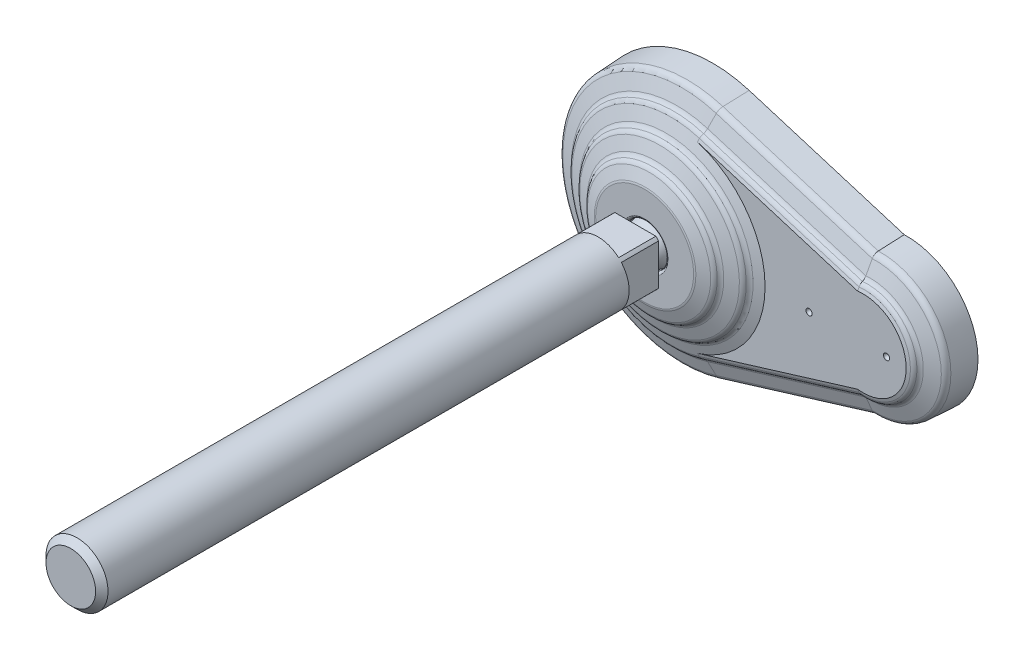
ISO-10303-21;
HEADER;
FILE_DESCRIPTION(('STEP AP214'),'2;1');
FILE_NAME('part.step','',(''),(''),'','','');
FILE_SCHEMA(('AUTOMOTIVE_DESIGN { 1 0 10303 214 1 1 1 1 }'));
ENDSEC;
DATA;
#1=APPLICATION_CONTEXT('core data for automotive mechanical design processes');
#2=APPLICATION_PROTOCOL_DEFINITION('international standard','automotive_design',2000,#1);
#3=PRODUCT_CONTEXT('',#1,'mechanical');
#4=PRODUCT('Part','Part','',(#3));
#5=PRODUCT_RELATED_PRODUCT_CATEGORY('part','',(#4));
#6=PRODUCT_DEFINITION_FORMATION('','',#4);
#7=PRODUCT_DEFINITION_CONTEXT('part definition',#1,'design');
#8=PRODUCT_DEFINITION('design','',#6,#7);
#9=PRODUCT_DEFINITION_SHAPE('','',#8);
#10=(LENGTH_UNIT() NAMED_UNIT(*) SI_UNIT(.MILLI.,.METRE.));
#11=(NAMED_UNIT(*) PLANE_ANGLE_UNIT() SI_UNIT($,.RADIAN.));
#12=(NAMED_UNIT(*) SI_UNIT($,.STERADIAN.) SOLID_ANGLE_UNIT());
#13=UNCERTAINTY_MEASURE_WITH_UNIT(LENGTH_MEASURE(1.E-05),#10,'distance_accuracy_value','');
#14=(GEOMETRIC_REPRESENTATION_CONTEXT(3) GLOBAL_UNCERTAINTY_ASSIGNED_CONTEXT((#13)) GLOBAL_UNIT_ASSIGNED_CONTEXT((#10,
#11,#12)) REPRESENTATION_CONTEXT('',''));
#15=CARTESIAN_POINT('',(0.,0.,0.));
#16=DIRECTION('',(0.,0.,1.));
#17=DIRECTION('',(1.,0.,0.));
#18=AXIS2_PLACEMENT_3D('',#15,#16,#17);
#19=CARTESIAN_POINT('',(0.,0.,37.));
#20=DIRECTION('',(0.,0.,1.));
#21=DIRECTION('',(-1.,0.,0.));
#22=AXIS2_PLACEMENT_3D('',#19,#20,#21);
#23=CYLINDRICAL_SURFACE('',#22,10.);
#24=CARTESIAN_POINT('',(0.,0.,205.));
#25=DIRECTION('',(0.,0.,1.));
#26=DIRECTION('',(-1.,0.,0.));
#27=AXIS2_PLACEMENT_3D('',#24,#25,#26);
#28=CIRCLE('',#27,10.);
#29=CARTESIAN_POINT('',(-10.,0.,205.));
#30=VERTEX_POINT('',#29);
#31=EDGE_CURVE('E9',#30,#30,#28,.F.);
#32=ORIENTED_EDGE('',*,*,#31,.T.);
#33=EDGE_LOOP('',(#32));
#34=FACE_BOUND('',#33,.T.);
#35=DIRECTION('',(0.,0.,1.));
#36=VECTOR('',#35,1.);
#37=CARTESIAN_POINT('',(-6.61437827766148,-7.5,37.));
#38=LINE('',#37,#36);
#39=CARTESIAN_POINT('',(-6.61437827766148,-7.5,37.));
#40=VERTEX_POINT('',#39);
#41=CARTESIAN_POINT('',(-6.61437827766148,-7.5,25.));
#42=VERTEX_POINT('',#41);
#43=EDGE_CURVE('E135',#40,#42,#38,.F.);
#44=ORIENTED_EDGE('',*,*,#43,.F.);
#45=CARTESIAN_POINT('',(0.,0.,37.));
#46=DIRECTION('',(0.,0.,1.));
#47=DIRECTION('',(0.,-1.,0.));
#48=AXIS2_PLACEMENT_3D('',#45,#46,#47);
#49=CIRCLE('',#48,10.);
#50=CARTESIAN_POINT('',(6.61437827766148,-7.5,37.));
#51=VERTEX_POINT('',#50);
#52=EDGE_CURVE('E506',#40,#51,#49,.T.);
#53=ORIENTED_EDGE('',*,*,#52,.T.);
#54=DIRECTION('',(0.,0.,1.));
#55=VECTOR('',#54,1.);
#56=CARTESIAN_POINT('',(6.61437827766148,-7.5,37.));
#57=LINE('',#56,#55);
#58=CARTESIAN_POINT('',(6.61437827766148,-7.5,25.));
#59=VERTEX_POINT('',#58);
#60=EDGE_CURVE('E200',#59,#51,#57,.T.);
#61=ORIENTED_EDGE('',*,*,#60,.F.);
#62=CARTESIAN_POINT('',(0.,0.,25.));
#63=DIRECTION('',(0.,0.,1.));
#64=DIRECTION('',(-1.,0.,0.));
#65=AXIS2_PLACEMENT_3D('',#62,#63,#64);
#66=CIRCLE('',#65,10.);
#67=CARTESIAN_POINT('',(7.5,-6.61437827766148,25.));
#68=VERTEX_POINT('',#67);
#69=EDGE_CURVE('E183',#59,#68,#66,.T.);
#70=ORIENTED_EDGE('',*,*,#69,.T.);
#71=DIRECTION('',(0.,0.,1.));
#72=VECTOR('',#71,1.);
#73=CARTESIAN_POINT('',(7.5,-6.61437827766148,37.));
#74=LINE('',#73,#72);
#75=CARTESIAN_POINT('',(7.5,-6.61437827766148,37.));
#76=VERTEX_POINT('',#75);
#77=EDGE_CURVE('E197',#76,#68,#74,.F.);
#78=ORIENTED_EDGE('',*,*,#77,.F.);
#79=CARTESIAN_POINT('',(7.5,6.61437827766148,37.));
#80=VERTEX_POINT('',#79);
#81=EDGE_CURVE('E265',#76,#80,#49,.T.);
#82=ORIENTED_EDGE('',*,*,#81,.T.);
#83=DIRECTION('',(0.,0.,1.));
#84=VECTOR('',#83,1.);
#85=CARTESIAN_POINT('',(7.5,6.61437827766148,37.));
#86=LINE('',#85,#84);
#87=CARTESIAN_POINT('',(7.5,6.61437827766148,25.));
#88=VERTEX_POINT('',#87);
#89=EDGE_CURVE('E242',#88,#80,#86,.T.);
#90=ORIENTED_EDGE('',*,*,#89,.F.);
#91=CARTESIAN_POINT('',(6.61437827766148,7.5,25.));
#92=VERTEX_POINT('',#91);
#93=EDGE_CURVE('E179',#88,#92,#66,.T.);
#94=ORIENTED_EDGE('',*,*,#93,.T.);
#95=DIRECTION('',(0.,0.,1.));
#96=VECTOR('',#95,1.);
#97=CARTESIAN_POINT('',(6.61437827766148,7.5,37.));
#98=LINE('',#97,#96);
#99=CARTESIAN_POINT('',(6.61437827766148,7.5,37.));
#100=VERTEX_POINT('',#99);
#101=EDGE_CURVE('E160',#100,#92,#98,.F.);
#102=ORIENTED_EDGE('',*,*,#101,.F.);
#103=CARTESIAN_POINT('',(-6.61437827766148,7.5,37.));
#104=VERTEX_POINT('',#103);
#105=EDGE_CURVE('E173',#100,#104,#49,.T.);
#106=ORIENTED_EDGE('',*,*,#105,.T.);
#107=DIRECTION('',(0.,0.,1.));
#108=VECTOR('',#107,1.);
#109=CARTESIAN_POINT('',(-6.61437827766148,7.5,37.));
#110=LINE('',#109,#108);
#111=CARTESIAN_POINT('',(-6.61437827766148,7.5,25.));
#112=VERTEX_POINT('',#111);
#113=EDGE_CURVE('E158',#112,#104,#110,.T.);
#114=ORIENTED_EDGE('',*,*,#113,.F.);
#115=CARTESIAN_POINT('',(-7.5,6.61437827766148,25.));
#116=VERTEX_POINT('',#115);
#117=EDGE_CURVE('E171',#112,#116,#66,.T.);
#118=ORIENTED_EDGE('',*,*,#117,.T.);
#119=DIRECTION('',(0.,0.,1.));
#120=VECTOR('',#119,1.);
#121=CARTESIAN_POINT('',(-7.5,6.61437827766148,37.));
#122=LINE('',#121,#120);
#123=CARTESIAN_POINT('',(-7.5,6.61437827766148,37.));
#124=VERTEX_POINT('',#123);
#125=EDGE_CURVE('E174',#124,#116,#122,.F.);
#126=ORIENTED_EDGE('',*,*,#125,.F.);
#127=CARTESIAN_POINT('',(-7.5,-6.61437827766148,37.));
#128=VERTEX_POINT('',#127);
#129=EDGE_CURVE('E516',#124,#128,#49,.T.);
#130=ORIENTED_EDGE('',*,*,#129,.T.);
#131=DIRECTION('',(0.,0.,1.));
#132=VECTOR('',#131,1.);
#133=CARTESIAN_POINT('',(-7.5,-6.61437827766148,37.));
#134=LINE('',#133,#132);
#135=CARTESIAN_POINT('',(-7.5,-6.61437827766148,25.));
#136=VERTEX_POINT('',#135);
#137=EDGE_CURVE('E180',#136,#128,#134,.T.);
#138=ORIENTED_EDGE('',*,*,#137,.F.);
#139=EDGE_CURVE('E182',#136,#42,#66,.T.);
#140=ORIENTED_EDGE('',*,*,#139,.T.);
#141=EDGE_LOOP('',(#44,#53,#61,#70,#78,#82,#90,#94,#102,#106,#114,#118,#126,#130,#138,#140));
#142=FACE_BOUND('',#141,.T.);
#143=ADVANCED_FACE('F14',(#34,#142),#23,.T.);
#144=CARTESIAN_POINT('',(-5.26544933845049,0.,25.));
#145=DIRECTION('',(0.,0.,1.));
#146=DIRECTION('',(-1.,0.,0.));
#147=AXIS2_PLACEMENT_3D('',#144,#145,#146);
#148=PLANE('',#147);
#149=DIRECTION('',(0.,-1.,0.));
#150=VECTOR('',#149,1.);
#151=CARTESIAN_POINT('',(-7.5,7.5,25.));
#152=LINE('',#151,#150);
#153=EDGE_CURVE('E31',#116,#136,#152,.T.);
#154=ORIENTED_EDGE('',*,*,#153,.F.);
#155=ORIENTED_EDGE('',*,*,#117,.F.);
#156=DIRECTION('',(-1.,0.,0.));
#157=VECTOR('',#156,1.);
#158=CARTESIAN_POINT('',(7.5,7.5,25.));
#159=LINE('',#158,#157);
#160=EDGE_CURVE('E153',#92,#112,#159,.T.);
#161=ORIENTED_EDGE('',*,*,#160,.F.);
#162=ORIENTED_EDGE('',*,*,#93,.F.);
#163=DIRECTION('',(0.,1.,0.));
#164=VECTOR('',#163,1.);
#165=CARTESIAN_POINT('',(7.5,-7.5,25.));
#166=LINE('',#165,#164);
#167=EDGE_CURVE('E165',#68,#88,#166,.T.);
#168=ORIENTED_EDGE('',*,*,#167,.F.);
#169=ORIENTED_EDGE('',*,*,#69,.F.);
#170=DIRECTION('',(1.,0.,0.));
#171=VECTOR('',#170,1.);
#172=CARTESIAN_POINT('',(-7.5,-7.5,25.));
#173=LINE('',#172,#171);
#174=EDGE_CURVE('E202',#42,#59,#173,.T.);
#175=ORIENTED_EDGE('',*,*,#174,.F.);
#176=ORIENTED_EDGE('',*,*,#139,.F.);
#177=EDGE_LOOP('',(#154,#155,#161,#162,#168,#169,#175,#176));
#178=FACE_BOUND('',#177,.T.);
#179=CARTESIAN_POINT('',(0.,0.,25.));
#180=DIRECTION('',(0.,0.,1.));
#181=DIRECTION('',(-1.,0.,0.));
#182=AXIS2_PLACEMENT_3D('',#179,#180,#181);
#183=CIRCLE('',#182,5.26544933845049);
#184=CARTESIAN_POINT('',(-5.26544933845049,0.,25.));
#185=VERTEX_POINT('',#184);
#186=EDGE_CURVE('E188',#185,#185,#183,.T.);
#187=ORIENTED_EDGE('',*,*,#186,.T.);
#188=EDGE_LOOP('',(#187));
#189=FACE_BOUND('',#188,.T.);
#190=ADVANCED_FACE('F176',(#178,#189),#148,.F.);
#191=CARTESIAN_POINT('',(0.,0.,18.6509999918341));
#192=DIRECTION('',(0.,0.,1.));
#193=DIRECTION('',(-1.,0.,0.));
#194=AXIS2_PLACEMENT_3D('',#191,#192,#193);
#195=DEGENERATE_TOROIDAL_SURFACE('',#194,0.000333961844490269,6.829,.T.);
#196=CARTESIAN_POINT('',(0.,0.,19.794));
#197=DIRECTION('',(0.,0.,-1.));
#198=DIRECTION('',(1.,0.,0.));
#199=AXIS2_PLACEMENT_3D('',#196,#197,#198);
#200=CIRCLE('',#199,6.733);
#201=CARTESIAN_POINT('',(6.733,0.,19.794));
#202=VERTEX_POINT('',#201);
#203=EDGE_CURVE('E249',#202,#202,#200,.T.);
#204=ORIENTED_EDGE('',*,*,#203,.F.);
#205=EDGE_LOOP('',(#204));
#206=FACE_BOUND('',#205,.T.);
#207=CARTESIAN_POINT('',(0.,0.,23.));
#208=DIRECTION('',(0.,0.,1.));
#209=DIRECTION('',(-1.,0.,0.));
#210=AXIS2_PLACEMENT_3D('',#207,#208,#209);
#211=CIRCLE('',#210,5.26544933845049);
#212=CARTESIAN_POINT('',(-5.26544933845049,0.,23.));
#213=VERTEX_POINT('',#212);
#214=EDGE_CURVE('E190',#213,#213,#211,.T.);
#215=ORIENTED_EDGE('',*,*,#214,.F.);
#216=EDGE_LOOP('',(#215));
#217=FACE_BOUND('',#216,.T.);
#218=ADVANCED_FACE('F450',(#206,#217),#195,.T.);
#219=CARTESIAN_POINT('',(0.,0.,37.));
#220=DIRECTION('',(0.,0.,1.));
#221=DIRECTION('',(-1.,0.,0.));
#222=AXIS2_PLACEMENT_3D('',#219,#220,#221);
#223=CYLINDRICAL_SURFACE('',#222,5.26544933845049);
#224=ORIENTED_EDGE('',*,*,#186,.F.);
#225=EDGE_LOOP('',(#224));
#226=FACE_BOUND('',#225,.T.);
#227=ORIENTED_EDGE('',*,*,#214,.T.);
#228=EDGE_LOOP('',(#227));
#229=FACE_BOUND('',#228,.T.);
#230=ADVANCED_FACE('F529',(#226,#229),#223,.T.);
#231=CARTESIAN_POINT('',(-7.5,-7.5,25.));
#232=DIRECTION('',(0.,-1.,0.));
#233=DIRECTION('',(1.,0.,0.));
#234=AXIS2_PLACEMENT_3D('',#231,#232,#233);
#235=PLANE('',#234);
#236=ORIENTED_EDGE('',*,*,#60,.T.);
#237=DIRECTION('',(-1.,0.,0.));
#238=VECTOR('',#237,1.);
#239=CARTESIAN_POINT('',(-10.,-7.5,37.));
#240=LINE('',#239,#238);
#241=EDGE_CURVE('E214',#51,#40,#240,.T.);
#242=ORIENTED_EDGE('',*,*,#241,.T.);
#243=ORIENTED_EDGE('',*,*,#43,.T.);
#244=ORIENTED_EDGE('',*,*,#174,.T.);
#245=EDGE_LOOP('',(#236,#242,#243,#244));
#246=FACE_BOUND('',#245,.T.);
#247=ADVANCED_FACE('F525',(#246),#235,.T.);
#248=CARTESIAN_POINT('',(7.5,-7.5,25.));
#249=DIRECTION('',(1.,0.,0.));
#250=DIRECTION('',(0.,1.,0.));
#251=AXIS2_PLACEMENT_3D('',#248,#249,#250);
#252=PLANE('',#251);
#253=ORIENTED_EDGE('',*,*,#89,.T.);
#254=DIRECTION('',(0.,-1.,0.));
#255=VECTOR('',#254,1.);
#256=CARTESIAN_POINT('',(7.5,0.,37.));
#257=LINE('',#256,#255);
#258=EDGE_CURVE('E221',#80,#76,#257,.T.);
#259=ORIENTED_EDGE('',*,*,#258,.T.);
#260=ORIENTED_EDGE('',*,*,#77,.T.);
#261=ORIENTED_EDGE('',*,*,#167,.T.);
#262=EDGE_LOOP('',(#253,#259,#260,#261));
#263=FACE_BOUND('',#262,.T.);
#264=ADVANCED_FACE('F540',(#263),#252,.T.);
#265=CARTESIAN_POINT('',(7.5,7.5,25.));
#266=DIRECTION('',(0.,1.,0.));
#267=DIRECTION('',(-1.,0.,0.));
#268=AXIS2_PLACEMENT_3D('',#265,#266,#267);
#269=PLANE('',#268);
#270=ORIENTED_EDGE('',*,*,#113,.T.);
#271=DIRECTION('',(1.,0.,0.));
#272=VECTOR('',#271,1.);
#273=CARTESIAN_POINT('',(-10.,7.5,37.));
#274=LINE('',#273,#272);
#275=EDGE_CURVE('E225',#104,#100,#274,.T.);
#276=ORIENTED_EDGE('',*,*,#275,.T.);
#277=ORIENTED_EDGE('',*,*,#101,.T.);
#278=ORIENTED_EDGE('',*,*,#160,.T.);
#279=EDGE_LOOP('',(#270,#276,#277,#278));
#280=FACE_BOUND('',#279,.T.);
#281=ADVANCED_FACE('F155',(#280),#269,.T.);
#282=CARTESIAN_POINT('',(-7.5,7.5,25.));
#283=DIRECTION('',(-1.,0.,0.));
#284=DIRECTION('',(0.,-1.,0.));
#285=AXIS2_PLACEMENT_3D('',#282,#283,#284);
#286=PLANE('',#285);
#287=ORIENTED_EDGE('',*,*,#137,.T.);
#288=DIRECTION('',(0.,1.,0.));
#289=VECTOR('',#288,1.);
#290=CARTESIAN_POINT('',(-7.5,0.,37.));
#291=LINE('',#290,#289);
#292=EDGE_CURVE('E238',#128,#124,#291,.T.);
#293=ORIENTED_EDGE('',*,*,#292,.T.);
#294=ORIENTED_EDGE('',*,*,#125,.T.);
#295=ORIENTED_EDGE('',*,*,#153,.T.);
#296=EDGE_LOOP('',(#287,#293,#294,#295));
#297=FACE_BOUND('',#296,.T.);
#298=ADVANCED_FACE('F461',(#297),#286,.T.);
#299=CARTESIAN_POINT('',(62.5,0.,0.));
#300=DIRECTION('',(0.,0.,-1.));
#301=DIRECTION('',(0.,1.,0.));
#302=AXIS2_PLACEMENT_3D('',#299,#300,#301);
#303=CONICAL_SURFACE('',#302,22.9787234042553,0.0523365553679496);
#304=CARTESIAN_POINT('',(62.5,0.,8.30411735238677));
#305=DIRECTION('',(0.,0.,1.));
#306=DIRECTION('',(0.,-1.,0.));
#307=AXIS2_PLACEMENT_3D('',#304,#305,#306);
#308=CIRCLE('',#307,22.5437172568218);
#309=CARTESIAN_POINT('',(61.6407011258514,-22.5273343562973,8.30411735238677));
#310=VERTEX_POINT('',#309);
#311=CARTESIAN_POINT('',(61.6407011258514,22.5273343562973,8.30411735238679));
#312=VERTEX_POINT('',#311);
#313=EDGE_CURVE('E284',#310,#312,#308,.T.);
#314=ORIENTED_EDGE('',*,*,#313,.F.);
#315=CARTESIAN_POINT('',(61.6406997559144,-22.5273238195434,8.30431735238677));
#316=CARTESIAN_POINT('',(61.6501805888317,-22.600242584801,6.92023165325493));
#317=CARTESIAN_POINT('',(61.6596900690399,-22.6731526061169,5.53614569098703));
#318=CARTESIAN_POINT('',(61.6787663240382,-22.8189551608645,2.76797324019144));
#319=CARTESIAN_POINT('',(61.6883330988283,-22.8918476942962,1.38388675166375));
#320=CARTESIAN_POINT('',(61.6979285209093,-22.9647314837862,-0.00020000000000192));
#321=B_SPLINE_CURVE_WITH_KNOTS('',3,(#315,#316,#317,#318,#319,#320),.UNSPECIFIED.,.F.,.F.,(4,2,
4),(0.,4.15811282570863,8.31622565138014),.UNSPECIFIED.);
#322=CARTESIAN_POINT('',(61.697927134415,-22.9647209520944,0.));
#323=VERTEX_POINT('',#322);
#324=EDGE_CURVE('E691',#310,#323,#321,.T.);
#325=ORIENTED_EDGE('',*,*,#324,.T.);
#326=CARTESIAN_POINT('',(62.5,0.,0.));
#327=DIRECTION('',(0.,0.,1.));
#328=DIRECTION('',(0.,-1.,0.));
#329=AXIS2_PLACEMENT_3D('',#326,#327,#328);
#330=CIRCLE('',#329,22.9787234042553);
#331=CARTESIAN_POINT('',(61.6979271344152,22.9647209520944,0.));
#332=VERTEX_POINT('',#331);
#333=EDGE_CURVE('E286',#323,#332,#330,.T.);
#334=ORIENTED_EDGE('',*,*,#333,.T.);
#335=CARTESIAN_POINT('',(61.6979285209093,22.9647314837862,-0.00019999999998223));
#336=CARTESIAN_POINT('',(61.6883330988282,22.8918476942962,1.38388675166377));
#337=CARTESIAN_POINT('',(61.6787663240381,22.8189551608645,2.76797324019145));
#338=CARTESIAN_POINT('',(61.6596900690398,22.6731526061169,5.53614569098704));
#339=CARTESIAN_POINT('',(61.6501805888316,22.600242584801,6.92023165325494));
#340=CARTESIAN_POINT('',(61.6406997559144,22.5273238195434,8.30431735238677));
#341=B_SPLINE_CURVE_WITH_KNOTS('',3,(#335,#336,#337,#338,#339,#340),.UNSPECIFIED.,.F.,.F.,(4,2,
4),(0.,4.1581128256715,8.31622565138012),.UNSPECIFIED.);
#342=EDGE_CURVE('E700',#332,#312,#341,.T.);
#343=ORIENTED_EDGE('',*,*,#342,.T.);
#344=EDGE_LOOP('',(#314,#325,#334,#343));
#345=FACE_BOUND('',#344,.T.);
#346=ADVANCED_FACE('F455',(#345),#303,.T.);
#347=CARTESIAN_POINT('',(64.1644462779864,-21.755748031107,8.30411735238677));
#348=DIRECTION('',(-0.291971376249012,0.9549953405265,-0.0523126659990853));
#349=DIRECTION('',(-0.956304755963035,-0.292371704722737,0.));
#350=AXIS2_PLACEMENT_3D('',#347,#348,#349);
#351=PLANE('',#350);
#352=ORIENTED_EDGE('',*,*,#324,.F.);
#353=DIRECTION('',(-0.956304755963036,-0.292371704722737,0.));
#354=VECTOR('',#353,1.);
#355=CARTESIAN_POINT('',(64.1644462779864,-21.755748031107,8.30411735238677));
#356=LINE('',#355,#354);
#357=CARTESIAN_POINT('',(11.5676847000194,-37.8361917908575,8.30411735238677));
#358=VERTEX_POINT('',#357);
#359=EDGE_CURVE('E620',#310,#358,#356,.T.);
#360=ORIENTED_EDGE('',*,*,#359,.T.);
#361=DIRECTION('',(-0.0152947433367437,0.050026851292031,0.998630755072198));
#362=VECTOR('',#361,1.);
#363=CARTESIAN_POINT('',(11.6948681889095,-38.2521902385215,0.));
#364=LINE('',#363,#362);
#365=CARTESIAN_POINT('',(11.6948681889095,-38.2521902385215,0.));
#366=VERTEX_POINT('',#365);
#367=EDGE_CURVE('E633',#366,#358,#364,.T.);
#368=ORIENTED_EDGE('',*,*,#367,.F.);
#369=DIRECTION('',(-0.956304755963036,-0.292371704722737,0.));
#370=VECTOR('',#369,1.);
#371=CARTESIAN_POINT('',(64.2916297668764,-22.1717464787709,0.));
#372=LINE('',#371,#370);
#373=EDGE_CURVE('E126',#323,#366,#372,.T.);
#374=ORIENTED_EDGE('',*,*,#373,.F.);
#375=EDGE_LOOP('',(#352,#360,#368,#374));
#376=FACE_BOUND('',#375,.T.);
#377=ADVANCED_FACE('F446',(#376),#351,.F.);
#378=CARTESIAN_POINT('',(0.,0.,0.));
#379=DIRECTION('',(0.,0.,1.));
#380=DIRECTION('',(-1.,0.,0.));
#381=AXIS2_PLACEMENT_3D('',#378,#379,#380);
#382=PLANE('',#381);
#383=DIRECTION('',(-0.956304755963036,0.292371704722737,0.));
#384=VECTOR('',#383,1.);
#385=CARTESIAN_POINT('',(64.2916297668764,22.1717464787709,0.));
#386=LINE('',#385,#384);
#387=CARTESIAN_POINT('',(11.6948681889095,38.2521902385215,0.));
#388=VERTEX_POINT('',#387);
#389=EDGE_CURVE('E618',#332,#388,#386,.T.);
#390=ORIENTED_EDGE('',*,*,#389,.F.);
#391=ORIENTED_EDGE('',*,*,#333,.F.);
#392=ORIENTED_EDGE('',*,*,#373,.T.);
#393=CARTESIAN_POINT('',(0.,0.,0.));
#394=DIRECTION('',(0.,0.,1.));
#395=DIRECTION('',(-1.,0.,0.));
#396=AXIS2_PLACEMENT_3D('',#393,#394,#395);
#397=CIRCLE('',#396,40.);
#398=EDGE_CURVE('E327',#388,#366,#397,.T.);
#399=ORIENTED_EDGE('',*,*,#398,.F.);
#400=EDGE_LOOP('',(#390,#391,#392,#399));
#401=FACE_BOUND('',#400,.T.);
#402=CARTESIAN_POINT('',(45.,0.,0.));
#403=DIRECTION('',(0.,0.,-1.));
#404=DIRECTION('',(0.,1.,0.));
#405=AXIS2_PLACEMENT_3D('',#402,#403,#404);
#406=CIRCLE('',#405,5.25);
#407=CARTESIAN_POINT('',(45.,5.25,0.));
#408=VERTEX_POINT('',#407);
#409=EDGE_CURVE('E503',#408,#408,#406,.T.);
#410=ORIENTED_EDGE('',*,*,#409,.F.);
#411=EDGE_LOOP('',(#410));
#412=FACE_BOUND('',#411,.T.);
#413=CARTESIAN_POINT('',(70.,0.,0.));
#414=DIRECTION('',(0.,0.,-1.));
#415=DIRECTION('',(0.,1.,0.));
#416=AXIS2_PLACEMENT_3D('',#413,#414,#415);
#417=CIRCLE('',#416,5.25);
#418=CARTESIAN_POINT('',(70.,5.25,0.));
#419=VERTEX_POINT('',#418);
#420=EDGE_CURVE('E500',#419,#419,#417,.T.);
#421=ORIENTED_EDGE('',*,*,#420,.F.);
#422=EDGE_LOOP('',(#421));
#423=FACE_BOUND('',#422,.T.);
#424=ADVANCED_FACE('F336',(#401,#412,#423),#382,.F.);
#425=CARTESIAN_POINT('',(64.2916297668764,22.1717464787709,0.));
#426=DIRECTION('',(-0.291971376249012,-0.9549953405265,-0.0523126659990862));
#427=DIRECTION('',(0.956304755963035,-0.292371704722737,0.));
#428=AXIS2_PLACEMENT_3D('',#425,#426,#427);
#429=PLANE('',#428);
#430=ORIENTED_EDGE('',*,*,#342,.F.);
#431=ORIENTED_EDGE('',*,*,#389,.T.);
#432=DIRECTION('',(-0.0152947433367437,-0.050026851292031,0.998630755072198));
#433=VECTOR('',#432,1.);
#434=CARTESIAN_POINT('',(11.6948681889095,38.2521902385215,0.));
#435=LINE('',#434,#433);
#436=CARTESIAN_POINT('',(11.5676847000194,37.8361917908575,8.30411735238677));
#437=VERTEX_POINT('',#436);
#438=EDGE_CURVE('E651',#388,#437,#435,.T.);
#439=ORIENTED_EDGE('',*,*,#438,.T.);
#440=DIRECTION('',(-0.956304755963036,0.292371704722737,0.));
#441=VECTOR('',#440,1.);
#442=CARTESIAN_POINT('',(64.1644462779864,21.755748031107,8.30411735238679));
#443=LINE('',#442,#441);
#444=EDGE_CURVE('E616',#312,#437,#443,.T.);
#445=ORIENTED_EDGE('',*,*,#444,.F.);
#446=EDGE_LOOP('',(#430,#431,#439,#445));
#447=FACE_BOUND('',#446,.T.);
#448=ADVANCED_FACE('F416',(#447),#429,.F.);
#449=CARTESIAN_POINT('',(62.5,0.,8.19912580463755));
#450=DIRECTION('',(0.,0.,1.));
#451=DIRECTION('',(0.,-1.,0.));
#452=AXIS2_PLACEMENT_3D('',#449,#450,#451);
#453=TOROIDAL_SURFACE('',#452,20.5394653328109,2.007);
#454=CARTESIAN_POINT('',(61.6407233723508,-22.5275054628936,8.09743405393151));
#455=CARTESIAN_POINT('',(61.6409510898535,-22.5292569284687,8.13179934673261));
#456=CARTESIAN_POINT('',(61.6410635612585,-22.5301219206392,8.16619641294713));
#457=CARTESIAN_POINT('',(61.6410572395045,-22.5300732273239,8.23504586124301));
#458=CARTESIAN_POINT('',(61.6409380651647,-22.5291566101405,8.26949824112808));
#459=CARTESIAN_POINT('',(61.6399396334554,-22.5214778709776,8.41537858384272));
#460=CARTESIAN_POINT('',(61.6379561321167,-22.5062239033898,8.52649092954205));
#461=CARTESIAN_POINT('',(61.6316126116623,-22.4573679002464,8.74462326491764));
#462=CARTESIAN_POINT('',(61.6272490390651,-22.4237384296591,8.85163687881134));
#463=CARTESIAN_POINT('',(61.6163034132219,-22.339189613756,9.05835724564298));
#464=CARTESIAN_POINT('',(61.6097238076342,-22.2882893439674,9.1580719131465));
#465=CARTESIAN_POINT('',(61.5945702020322,-22.1707054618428,9.34754679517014));
#466=CARTESIAN_POINT('',(61.5859960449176,-22.1040206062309,9.43730622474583));
#467=CARTESIAN_POINT('',(61.5670698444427,-21.9562760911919,9.60507832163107));
#468=CARTESIAN_POINT('',(61.5567047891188,-21.8751110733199,9.68299656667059));
#469=CARTESIAN_POINT('',(61.5345911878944,-21.7011851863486,9.82410142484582));
#470=CARTESIAN_POINT('',(61.5228449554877,-21.6084436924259,9.88731215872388));
#471=CARTESIAN_POINT('',(61.5046129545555,-21.4637836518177,9.96928669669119));
#472=CARTESIAN_POINT('',(61.4985079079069,-21.4152343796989,9.99425235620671));
#473=CARTESIAN_POINT('',(61.4860940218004,-21.3162718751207,10.0401972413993));
#474=CARTESIAN_POINT('',(61.4797850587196,-21.2658575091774,10.0611739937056));
#475=CARTESIAN_POINT('',(61.4596293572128,-21.1043762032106,10.1208327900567));
#476=CARTESIAN_POINT('',(61.4454888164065,-20.9904779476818,10.1519983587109));
#477=CARTESIAN_POINT('',(61.4169436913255,-20.7591475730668,10.1941665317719));
#478=CARTESIAN_POINT('',(61.4025394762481,-20.6417202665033,10.2051954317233));
#479=CARTESIAN_POINT('',(61.3876252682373,-20.5193667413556,10.2061070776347));
#480=CARTESIAN_POINT('',(61.3870090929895,-20.5143103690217,10.2061258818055));
#481=CARTESIAN_POINT('',(61.3863931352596,-20.5092543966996,10.2061258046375));
#482=B_SPLINE_CURVE_WITH_KNOTS('',3,(#454,#455,#456,#457,#458,#459,#460,#461,#462,#463,#464,
#465,#466,#467,#468,#469,#470,#471,#472,#473,#474,#475,#476,#477,#478,#479,#480,#481),
.UNSPECIFIED.,.F.,.F.,(4,2,2,2,2,2,2,2,2,2,2,2,2,4),(0.,0.103191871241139,0.20655369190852,
0.54127575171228,0.87649892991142,1.21135305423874,1.54623356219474,1.88365820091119,
2.2205254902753,2.38517216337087,2.54992059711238,2.90486008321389,3.2593357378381,
3.2746170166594),.UNSPECIFIED.);
#483=CARTESIAN_POINT('',(61.4734629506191,-21.2152067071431,10.0798866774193));
#484=VERTEX_POINT('',#483);
#485=EDGE_CURVE('E693',#310,#484,#482,.T.);
#486=ORIENTED_EDGE('',*,*,#485,.F.);
#487=ORIENTED_EDGE('',*,*,#313,.T.);
#488=CARTESIAN_POINT('',(61.3863931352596,20.5092543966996,10.2061258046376));
#489=CARTESIAN_POINT('',(61.3870091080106,20.5143104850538,10.2061258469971));
#490=CARTESIAN_POINT('',(61.3876252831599,20.5193668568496,10.206107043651));
#491=CARTESIAN_POINT('',(61.3988855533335,20.6117442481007,10.2054193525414));
#492=CARTESIAN_POINT('',(61.4095840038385,20.6991031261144,10.1991511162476));
#493=CARTESIAN_POINT('',(61.4308936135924,20.8723273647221,10.1754412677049));
#494=CARTESIAN_POINT('',(61.4415047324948,20.9581920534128,10.1579947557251));
#495=CARTESIAN_POINT('',(61.4555813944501,21.0716202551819,10.1272225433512));
#496=CARTESIAN_POINT('',(61.4591730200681,21.1005182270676,10.1186877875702));
#497=CARTESIAN_POINT('',(61.4663157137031,21.1579059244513,10.1003430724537));
#498=CARTESIAN_POINT('',(61.4698667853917,21.1863956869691,10.090533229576));
#499=CARTESIAN_POINT('',(61.4866782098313,21.3210820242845,10.0407628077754));
#500=CARTESIAN_POINT('',(61.4996430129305,21.4243838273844,9.99241683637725));
#501=CARTESIAN_POINT('',(61.5245148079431,21.6216549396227,9.87891981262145));
#502=CARTESIAN_POINT('',(61.5364193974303,21.7156031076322,9.81373183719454));
#503=CARTESIAN_POINT('',(61.5587594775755,21.8912250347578,9.66834297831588));
#504=CARTESIAN_POINT('',(61.5691956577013,21.9729045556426,9.58814918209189));
#505=CARTESIAN_POINT('',(61.5882470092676,22.1215501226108,9.41495435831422));
#506=CARTESIAN_POINT('',(61.5968625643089,22.1885192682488,9.32195603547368));
#507=CARTESIAN_POINT('',(61.6119005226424,22.3051440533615,9.12674801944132));
#508=CARTESIAN_POINT('',(61.6183432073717,22.3549598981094,9.02463544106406));
#509=CARTESIAN_POINT('',(61.6289130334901,22.4365717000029,8.81343456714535));
#510=CARTESIAN_POINT('',(61.6330436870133,22.4683949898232,8.70435713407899));
#511=CARTESIAN_POINT('',(61.6371976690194,22.5003783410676,8.54571963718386));
#512=CARTESIAN_POINT('',(61.6382205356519,22.5082502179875,8.49762935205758));
#513=CARTESIAN_POINT('',(61.639806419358,22.5204527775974,8.40103137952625));
#514=CARTESIAN_POINT('',(61.6403698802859,22.52478687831,8.35252414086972));
#515=CARTESIAN_POINT('',(61.6411729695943,22.5309631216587,8.23516417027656));
#516=CARTESIAN_POINT('',(61.641181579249,22.5310278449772,8.16621181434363));
#517=CARTESIAN_POINT('',(61.6407233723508,22.5275054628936,8.09743405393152));
#518=B_SPLINE_CURVE_WITH_KNOTS('',3,(#488,#489,#490,#491,#492,#493,#494,#495,#496,#497,#498,
#499,#500,#501,#502,#503,#504,#505,#506,#507,#508,#509,#510,#511,#512,#513,#514,#515,#516,#517),
.UNSPECIFIED.,.F.,.F.,(4,2,2,2,2,2,2,2,2,2,2,2,2,2,4),(0.,0.0152812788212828,0.27917431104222,
0.543183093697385,0.634194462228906,0.725197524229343,1.06775959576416,1.41107914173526,
1.75423694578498,2.09732237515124,2.43711059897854,2.77638125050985,2.92250118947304,
3.06847978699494,3.27496314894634),.UNSPECIFIED.);
#519=CARTESIAN_POINT('',(61.4734629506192,21.2152067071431,10.0798866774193));
#520=VERTEX_POINT('',#519);
#521=EDGE_CURVE('E405',#520,#312,#518,.T.);
#522=ORIENTED_EDGE('',*,*,#521,.F.);
#523=CARTESIAN_POINT('',(62.5,0.,10.0798866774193));
#524=DIRECTION('',(0.,0.,1.));
#525=DIRECTION('',(0.,-1.,0.));
#526=AXIS2_PLACEMENT_3D('',#523,#524,#525);
#527=CIRCLE('',#526,21.2400276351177);
#528=EDGE_CURVE('E282',#484,#520,#527,.T.);
#529=ORIENTED_EDGE('',*,*,#528,.F.);
#530=EDGE_LOOP('',(#486,#487,#522,#529));
#531=FACE_BOUND('',#530,.T.);
#532=ADVANCED_FACE('F387',(#531),#453,.T.);
#533=CARTESIAN_POINT('',(63.5784597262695,-19.8390723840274,8.19912580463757));
#534=DIRECTION('',(-0.956304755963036,-0.292371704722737,0.));
#535=DIRECTION('',(0.292371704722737,-0.956304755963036,0.));
#536=AXIS2_PLACEMENT_3D('',#533,#534,#535);
#537=CYLINDRICAL_SURFACE('',#536,2.00699999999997);
#538=ORIENTED_EDGE('',*,*,#359,.F.);
#539=ORIENTED_EDGE('',*,*,#485,.T.);
#540=DIRECTION('',(-0.956304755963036,-0.292371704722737,0.));
#541=VECTOR('',#540,1.);
#542=CARTESIAN_POINT('',(63.7832843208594,-20.5090234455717,10.0798866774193));
#543=LINE('',#542,#541);
#544=CARTESIAN_POINT('',(11.1865227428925,-36.5894672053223,10.0798866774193));
#545=VERTEX_POINT('',#544);
#546=EDGE_CURVE('E622',#484,#545,#543,.T.);
#547=ORIENTED_EDGE('',*,*,#546,.T.);
#548=CARTESIAN_POINT('',(10.9816981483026,-35.9195161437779,8.19912580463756));
#549=DIRECTION('',(0.956304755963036,0.292371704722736,0.));
#550=DIRECTION('',(-0.292371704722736,0.956304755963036,0.));
#551=AXIS2_PLACEMENT_3D('',#548,#549,#550);
#552=CIRCLE('',#551,2.007);
#553=EDGE_CURVE('E636',#545,#358,#552,.T.);
#554=ORIENTED_EDGE('',*,*,#553,.T.);
#555=EDGE_LOOP('',(#538,#539,#547,#554));
#556=FACE_BOUND('',#555,.T.);
#557=ADVANCED_FACE('F417',(#556),#537,.T.);
#558=CARTESIAN_POINT('',(0.,0.,0.));
#559=DIRECTION('',(0.,0.,-1.));
#560=DIRECTION('',(1.,0.,0.));
#561=AXIS2_PLACEMENT_3D('',#558,#559,#560);
#562=CONICAL_SURFACE('',#561,40.,0.0523365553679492);
#563=CARTESIAN_POINT('',(0.,0.,8.30411735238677));
#564=DIRECTION('',(0.,0.,1.));
#565=DIRECTION('',(-1.,0.,0.));
#566=AXIS2_PLACEMENT_3D('',#563,#564,#565);
#567=CIRCLE('',#566,39.5649938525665);
#568=EDGE_CURVE('E680',#437,#358,#567,.T.);
#569=ORIENTED_EDGE('',*,*,#568,.F.);
#570=ORIENTED_EDGE('',*,*,#438,.F.);
#571=ORIENTED_EDGE('',*,*,#398,.T.);
#572=ORIENTED_EDGE('',*,*,#367,.T.);
#573=EDGE_LOOP('',(#569,#570,#571,#572));
#574=FACE_BOUND('',#573,.T.);
#575=ADVANCED_FACE('F437',(#574),#562,.T.);
#576=CARTESIAN_POINT('',(63.5784597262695,19.8390723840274,8.1991258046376));
#577=DIRECTION('',(-0.956304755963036,0.292371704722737,0.));
#578=DIRECTION('',(-0.292371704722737,-0.956304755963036,0.));
#579=AXIS2_PLACEMENT_3D('',#576,#577,#578);
#580=CYLINDRICAL_SURFACE('',#579,2.00699999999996);
#581=DIRECTION('',(-0.956304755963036,0.292371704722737,0.));
#582=VECTOR('',#581,1.);
#583=CARTESIAN_POINT('',(63.7832843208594,20.5090234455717,10.0798866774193));
#584=LINE('',#583,#582);
#585=CARTESIAN_POINT('',(11.1865227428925,36.5894672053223,10.0798866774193));
#586=VERTEX_POINT('',#585);
#587=EDGE_CURVE('E614',#520,#586,#584,.T.);
#588=ORIENTED_EDGE('',*,*,#587,.F.);
#589=ORIENTED_EDGE('',*,*,#521,.T.);
#590=ORIENTED_EDGE('',*,*,#444,.T.);
#591=CARTESIAN_POINT('',(10.9816981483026,35.9195161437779,8.19912580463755));
#592=DIRECTION('',(-0.956304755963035,0.292371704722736,0.));
#593=DIRECTION('',(-0.292371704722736,-0.956304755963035,0.));
#594=AXIS2_PLACEMENT_3D('',#591,#592,#593);
#595=CIRCLE('',#594,2.007);
#596=EDGE_CURVE('E654',#586,#437,#595,.T.);
#597=ORIENTED_EDGE('',*,*,#596,.F.);
#598=EDGE_LOOP('',(#588,#589,#590,#597));
#599=FACE_BOUND('',#598,.T.);
#600=ADVANCED_FACE('F345',(#599),#580,.T.);
#601=CARTESIAN_POINT('',(62.5,0.,10.0798866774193));
#602=DIRECTION('',(0.,0.,-1.));
#603=DIRECTION('',(0.,1.,0.));
#604=AXIS2_PLACEMENT_3D('',#601,#602,#603);
#605=CONICAL_SURFACE('',#604,21.2400276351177,1.21422909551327);
#606=CARTESIAN_POINT('',(62.5,0.,11.656251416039));
#607=DIRECTION('',(0.,0.,1.));
#608=DIRECTION('',(0.,-1.,0.));
#609=AXIS2_PLACEMENT_3D('',#606,#607,#608);
#610=CIRCLE('',#609,17.0080484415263);
#611=CARTESIAN_POINT('',(60.9818619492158,-16.9401584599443,11.656251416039));
#612=VERTEX_POINT('',#611);
#613=CARTESIAN_POINT('',(60.9818619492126,16.9401584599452,11.656251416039));
#614=VERTEX_POINT('',#613);
#615=EDGE_CURVE('E280',#612,#614,#610,.T.);
#616=ORIENTED_EDGE('',*,*,#615,.F.);
#617=CARTESIAN_POINT('',(60.9818053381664,-16.9396143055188,11.656451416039));
#618=CARTESIAN_POINT('',(61.0189355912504,-17.2964789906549,11.5252879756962));
#619=CARTESIAN_POINT('',(61.0571375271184,-17.653206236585,11.3940567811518));
#620=CARTESIAN_POINT('',(61.1355151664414,-18.3663907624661,11.1314756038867));
#621=CARTESIAN_POINT('',(61.1756908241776,-18.7228480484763,11.0001256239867));
#622=CARTESIAN_POINT('',(61.2578477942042,-19.435511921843,10.7373183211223));
#623=CARTESIAN_POINT('',(61.2998290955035,-19.7917185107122,10.6058609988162));
#624=CARTESIAN_POINT('',(61.3854616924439,-20.5039033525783,10.3428458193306));
#625=CARTESIAN_POINT('',(61.4291130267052,-20.8598816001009,10.2112879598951));
#626=CARTESIAN_POINT('',(61.4735304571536,-21.2157475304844,10.0796866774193));
#627=B_SPLINE_CURVE_WITH_KNOTS('',3,(#617,#618,#619,#620,#621,#622,#623,#624,#625,#626),
.UNSPECIFIED.,.F.,.F.,(4,2,2,2,4),(0.,1.14603990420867,2.29205327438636,3.43805966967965,
4.58409258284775),.UNSPECIFIED.);
#628=EDGE_CURVE('E397',#612,#484,#627,.T.);
#629=ORIENTED_EDGE('',*,*,#628,.T.);
#630=ORIENTED_EDGE('',*,*,#528,.T.);
#631=CARTESIAN_POINT('',(61.4735304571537,21.2157475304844,10.0796866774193));
#632=CARTESIAN_POINT('',(61.4291130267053,20.8598816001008,10.2112879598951));
#633=CARTESIAN_POINT('',(61.3854616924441,20.5039033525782,10.3428458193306));
#634=CARTESIAN_POINT('',(61.2998290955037,19.7917185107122,10.6058609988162));
#635=CARTESIAN_POINT('',(61.2578477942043,19.435511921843,10.7373183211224));
#636=CARTESIAN_POINT('',(61.1756908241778,18.7228480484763,11.0001256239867));
#637=CARTESIAN_POINT('',(61.1355151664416,18.3663907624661,11.1314756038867));
#638=CARTESIAN_POINT('',(61.0571375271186,17.653206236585,11.3940567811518));
#639=CARTESIAN_POINT('',(61.0189355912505,17.2964789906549,11.5252879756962));
#640=CARTESIAN_POINT('',(60.9818053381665,16.9396143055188,11.656451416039));
#641=B_SPLINE_CURVE_WITH_KNOTS('',3,(#631,#632,#633,#634,#635,#636,#637,#638,#639,#640),
.UNSPECIFIED.,.F.,.F.,(4,2,2,2,4),(0.,1.1460329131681,2.29203930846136,3.43805267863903,
4.58409258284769),.UNSPECIFIED.);
#642=EDGE_CURVE('E391',#520,#614,#641,.T.);
#643=ORIENTED_EDGE('',*,*,#642,.T.);
#644=EDGE_LOOP('',(#616,#629,#630,#643));
#645=FACE_BOUND('',#644,.T.);
#646=ADVANCED_FACE('F380',(#645),#605,.T.);
#647=CARTESIAN_POINT('',(62.545973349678,-16.4619616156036,11.656251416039));
#648=DIRECTION('',(-0.102055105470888,0.333807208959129,-0.937100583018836));
#649=DIRECTION('',(0.,0.942019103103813,0.335559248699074));
#650=AXIS2_PLACEMENT_3D('',#647,#648,#649);
#651=PLANE('',#650);
#652=ORIENTED_EDGE('',*,*,#628,.F.);
#653=DIRECTION('',(-0.956304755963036,-0.292371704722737,0.));
#654=VECTOR('',#653,1.);
#655=CARTESIAN_POINT('',(62.545973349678,-16.4619616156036,11.656251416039));
#656=LINE('',#655,#654);
#657=CARTESIAN_POINT('',(9.949211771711,-32.5424053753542,11.656251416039));
#658=VERTEX_POINT('',#657);
#659=EDGE_CURVE('E624',#612,#658,#656,.T.);
#660=ORIENTED_EDGE('',*,*,#659,.T.);
#661=DIRECTION('',(-0.273981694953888,0.896153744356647,0.349059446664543));
#662=VECTOR('',#661,1.);
#663=CARTESIAN_POINT('',(11.1865227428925,-36.5894672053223,10.0798866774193));
#664=LINE('',#663,#662);
#665=EDGE_CURVE('E639',#545,#658,#664,.T.);
#666=ORIENTED_EDGE('',*,*,#665,.F.);
#667=ORIENTED_EDGE('',*,*,#546,.F.);
#668=EDGE_LOOP('',(#652,#660,#666,#667));
#669=FACE_BOUND('',#668,.T.);
#670=ADVANCED_FACE('F385',(#669),#651,.F.);
#671=CARTESIAN_POINT('',(0.,0.,8.19912580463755));
#672=DIRECTION('',(0.,0.,1.));
#673=DIRECTION('',(-1.,0.,0.));
#674=AXIS2_PLACEMENT_3D('',#671,#672,#673);
#675=TOROIDAL_SURFACE('',#674,37.5607419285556,2.007);
#676=CARTESIAN_POINT('',(0.,0.,10.0798866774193));
#677=DIRECTION('',(0.,0.,1.));
#678=DIRECTION('',(-1.,0.,0.));
#679=AXIS2_PLACEMENT_3D('',#676,#677,#678);
#680=CIRCLE('',#679,38.2613042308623);
#681=EDGE_CURVE('E678',#586,#545,#680,.T.);
#682=ORIENTED_EDGE('',*,*,#681,.F.);
#683=ORIENTED_EDGE('',*,*,#596,.T.);
#684=ORIENTED_EDGE('',*,*,#568,.T.);
#685=ORIENTED_EDGE('',*,*,#553,.F.);
#686=EDGE_LOOP('',(#682,#683,#684,#685));
#687=FACE_BOUND('',#686,.T.);
#688=ADVANCED_FACE('F414',(#687),#675,.T.);
#689=CARTESIAN_POINT('',(63.7832843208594,20.5090234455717,10.0798866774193));
#690=DIRECTION('',(-0.102055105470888,-0.333807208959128,-0.937100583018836));
#691=DIRECTION('',(0.,0.942019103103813,-0.335559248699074));
#692=AXIS2_PLACEMENT_3D('',#689,#690,#691);
#693=PLANE('',#692);
#694=ORIENTED_EDGE('',*,*,#642,.F.);
#695=ORIENTED_EDGE('',*,*,#587,.T.);
#696=DIRECTION('',(-0.273981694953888,-0.896153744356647,0.349059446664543));
#697=VECTOR('',#696,1.);
#698=CARTESIAN_POINT('',(11.1865227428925,36.5894672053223,10.0798866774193));
#699=LINE('',#698,#697);
#700=CARTESIAN_POINT('',(9.949211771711,32.5424053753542,11.656251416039));
#701=VERTEX_POINT('',#700);
#702=EDGE_CURVE('E657',#586,#701,#699,.T.);
#703=ORIENTED_EDGE('',*,*,#702,.T.);
#704=DIRECTION('',(-0.956304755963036,0.292371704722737,0.));
#705=VECTOR('',#704,1.);
#706=CARTESIAN_POINT('',(62.545973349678,16.4619616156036,11.656251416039));
#707=LINE('',#706,#705);
#708=EDGE_CURVE('E612',#614,#701,#707,.T.);
#709=ORIENTED_EDGE('',*,*,#708,.F.);
#710=EDGE_LOOP('',(#694,#695,#703,#709));
#711=FACE_BOUND('',#710,.T.);
#712=ADVANCED_FACE('F351',(#711),#693,.F.);
#713=CARTESIAN_POINT('',(62.5,0.,13.5370123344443));
#714=DIRECTION('',(0.,0.,1.));
#715=DIRECTION('',(0.,-1.,0.));
#716=AXIS2_PLACEMENT_3D('',#713,#714,#715);
#717=TOROIDAL_SURFACE('',#716,17.70861062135,2.007);
#718=CARTESIAN_POINT('',(60.9819185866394,-16.9407028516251,11.656051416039));
#719=CARTESIAN_POINT('',(60.9763282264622,-16.8869710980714,11.675784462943));
#720=CARTESIAN_POINT('',(60.9708503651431,-16.8340792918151,11.697757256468));
#721=CARTESIAN_POINT('',(60.9601474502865,-16.7302929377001,11.7460604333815));
#722=CARTESIAN_POINT('',(60.9549224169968,-16.6793985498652,11.77239116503));
#723=CARTESIAN_POINT('',(60.9396574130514,-16.5300811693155,11.8578002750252));
#724=CARTESIAN_POINT('',(60.9300410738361,-16.4351542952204,11.9232476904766));
#725=CARTESIAN_POINT('',(60.9121877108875,-16.2575900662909,12.0693279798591));
#726=CARTESIAN_POINT('',(60.9039521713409,-16.1749659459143,12.1499769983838));
#727=CARTESIAN_POINT('',(60.8890756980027,-16.0247595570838,12.3241094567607));
#728=CARTESIAN_POINT('',(60.8824301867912,-15.9571341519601,12.4175548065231));
#729=CARTESIAN_POINT('',(60.8754548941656,-15.8858007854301,12.5364334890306));
#730=CARTESIAN_POINT('',(60.8742920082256,-15.8738939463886,12.5571086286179));
#731=CARTESIAN_POINT('',(60.8720425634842,-15.8508368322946,12.59885583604));
#732=CARTESIAN_POINT('',(60.8709559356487,-15.839685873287,12.6199275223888));
#733=CARTESIAN_POINT('',(60.869906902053,-15.8289098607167,12.6412000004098));
#734=B_SPLINE_CURVE_WITH_KNOTS('',3,(#718,#719,#720,#721,#722,#723,#724,#725,#726,#727,#728,
#729,#730,#731,#732,#733),.UNSPECIFIED.,.F.,.F.,(4,2,2,2,2,2,2,4),(0.,0.172434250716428,
0.34488228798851,0.690191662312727,1.0358698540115,1.38054058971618,1.4521941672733,
1.52378201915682),.UNSPECIFIED.);
#735=CARTESIAN_POINT('',(60.8699167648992,-15.8290111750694,12.6410000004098));
#736=VERTEX_POINT('',#735);
#737=EDGE_CURVE('E362',#612,#736,#734,.T.);
#738=ORIENTED_EDGE('',*,*,#737,.F.);
#739=ORIENTED_EDGE('',*,*,#615,.T.);
#740=CARTESIAN_POINT('',(60.869906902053,15.8289098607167,12.6412000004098));
#741=CARTESIAN_POINT('',(60.8724049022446,15.8545692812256,12.5905409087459));
#742=CARTESIAN_POINT('',(60.8751177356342,15.882373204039,12.5410120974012));
#743=CARTESIAN_POINT('',(60.8809599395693,15.9420653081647,12.4445128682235));
#744=CARTESIAN_POINT('',(60.8840892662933,15.9739530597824,12.3975421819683));
#745=CARTESIAN_POINT('',(60.8940798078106,16.0754098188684,12.2609440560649));
#746=CARTESIAN_POINT('',(60.9015461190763,16.1507985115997,12.1755790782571));
#747=CARTESIAN_POINT('',(60.9179069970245,16.3146445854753,12.0187596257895));
#748=CARTESIAN_POINT('',(60.9268017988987,16.4031041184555,11.9473074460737));
#749=CARTESIAN_POINT('',(60.9458071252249,16.5904449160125,11.8202080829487));
#750=CARTESIAN_POINT('',(60.9559150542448,16.6893038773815,11.7645279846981));
#751=CARTESIAN_POINT('',(60.9690169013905,16.8162843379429,11.7062217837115));
#752=CARTESIAN_POINT('',(60.9715630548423,16.8409104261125,11.6954970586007));
#753=CARTESIAN_POINT('',(60.9767040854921,16.8905299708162,11.6750365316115));
#754=CARTESIAN_POINT('',(60.9792989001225,16.9155229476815,11.6652995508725));
#755=CARTESIAN_POINT('',(60.9819185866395,16.940702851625,11.656051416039));
#756=B_SPLINE_CURVE_WITH_KNOTS('',3,(#740,#741,#742,#743,#744,#745,#746,#747,#748,#749,#750,
#751,#752,#753,#754,#755),.UNSPECIFIED.,.F.,.F.,(4,2,2,2,2,2,2,4),(0.,0.170415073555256,
0.340812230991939,0.681435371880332,1.0221146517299,1.36207763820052,1.44300799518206,
1.52384059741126),.UNSPECIFIED.);
#757=CARTESIAN_POINT('',(60.8699167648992,15.8290111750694,12.6410000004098));
#758=VERTEX_POINT('',#757);
#759=EDGE_CURVE('E355',#758,#614,#756,.T.);
#760=ORIENTED_EDGE('',*,*,#759,.F.);
#761=CARTESIAN_POINT('',(62.5,0.,12.6410000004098));
#762=DIRECTION('',(0.,0.,1.));
#763=DIRECTION('',(0.,-1.,0.));
#764=AXIS2_PLACEMENT_3D('',#761,#762,#763);
#765=CIRCLE('',#764,15.9127234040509);
#766=EDGE_CURVE('E278',#736,#758,#765,.T.);
#767=ORIENTED_EDGE('',*,*,#766,.F.);
#768=EDGE_LOOP('',(#738,#739,#760,#767));
#769=FACE_BOUND('',#768,.T.);
#770=ADVANCED_FACE('F374',(#769),#717,.F.);
#771=CARTESIAN_POINT('',(62.7507979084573,-17.131912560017,13.5370123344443));
#772=DIRECTION('',(-0.956304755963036,-0.292371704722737,0.));
#773=DIRECTION('',(0.292371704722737,-0.956304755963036,0.));
#774=AXIS2_PLACEMENT_3D('',#771,#772,#773);
#775=CYLINDRICAL_SURFACE('',#774,2.00700000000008);
#776=ORIENTED_EDGE('',*,*,#659,.F.);
#777=ORIENTED_EDGE('',*,*,#737,.T.);
#778=DIRECTION('',(-0.956304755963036,-0.292371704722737,0.));
#779=VECTOR('',#778,1.);
#780=CARTESIAN_POINT('',(62.2257313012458,-15.4144970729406,12.6410000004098));
#781=LINE('',#780,#779);
#782=CARTESIAN_POINT('',(9.62896972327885,-31.4949408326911,12.6410000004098));
#783=VERTEX_POINT('',#782);
#784=EDGE_CURVE('E626',#736,#783,#781,.T.);
#785=ORIENTED_EDGE('',*,*,#784,.T.);
#786=CARTESIAN_POINT('',(10.1540363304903,-33.2123563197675,13.5370123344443));
#787=DIRECTION('',(0.956304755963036,0.292371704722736,0.));
#788=DIRECTION('',(-0.292371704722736,0.956304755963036,0.));
#789=AXIS2_PLACEMENT_3D('',#786,#787,#788);
#790=CIRCLE('',#789,2.00700000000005);
#791=EDGE_CURVE('E642',#658,#783,#790,.T.);
#792=ORIENTED_EDGE('',*,*,#791,.F.);
#793=EDGE_LOOP('',(#776,#777,#785,#792));
#794=FACE_BOUND('',#793,.T.);
#795=ADVANCED_FACE('F378',(#794),#775,.F.);
#796=CARTESIAN_POINT('',(0.,0.,10.0798866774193));
#797=DIRECTION('',(0.,0.,-1.));
#798=DIRECTION('',(1.,0.,0.));
#799=AXIS2_PLACEMENT_3D('',#796,#797,#798);
#800=CONICAL_SURFACE('',#799,38.2613042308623,1.21422909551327);
#801=CARTESIAN_POINT('',(0.,0.,11.656251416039));
#802=DIRECTION('',(0.,0.,1.));
#803=DIRECTION('',(-1.,0.,0.));
#804=AXIS2_PLACEMENT_3D('',#801,#802,#803);
#805=CIRCLE('',#804,34.0293250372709);
#806=EDGE_CURVE('E675',#701,#658,#805,.T.);
#807=ORIENTED_EDGE('',*,*,#806,.F.);
#808=ORIENTED_EDGE('',*,*,#702,.F.);
#809=ORIENTED_EDGE('',*,*,#681,.T.);
#810=ORIENTED_EDGE('',*,*,#665,.T.);
#811=EDGE_LOOP('',(#807,#808,#809,#810));
#812=FACE_BOUND('',#811,.T.);
#813=ADVANCED_FACE('F349',(#812),#800,.T.);
#814=CARTESIAN_POINT('',(62.7507979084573,17.1319125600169,13.5370123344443));
#815=DIRECTION('',(-0.956304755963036,0.292371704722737,0.));
#816=DIRECTION('',(-0.292371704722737,-0.956304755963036,0.));
#817=AXIS2_PLACEMENT_3D('',#814,#815,#816);
#818=CYLINDRICAL_SURFACE('',#817,2.007);
#819=DIRECTION('',(-0.956304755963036,0.292371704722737,0.));
#820=VECTOR('',#819,1.);
#821=CARTESIAN_POINT('',(62.2257313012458,15.4144970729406,12.6410000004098));
#822=LINE('',#821,#820);
#823=CARTESIAN_POINT('',(9.62896972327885,31.4949408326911,12.6410000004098));
#824=VERTEX_POINT('',#823);
#825=EDGE_CURVE('E610',#758,#824,#822,.T.);
#826=ORIENTED_EDGE('',*,*,#825,.F.);
#827=ORIENTED_EDGE('',*,*,#759,.T.);
#828=ORIENTED_EDGE('',*,*,#708,.T.);
#829=CARTESIAN_POINT('',(10.1540363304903,33.2123563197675,13.5370123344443));
#830=DIRECTION('',(-0.956304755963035,0.292371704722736,0.));
#831=DIRECTION('',(-0.292371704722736,-0.956304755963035,0.));
#832=AXIS2_PLACEMENT_3D('',#829,#830,#831);
#833=CIRCLE('',#832,2.00700000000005);
#834=EDGE_CURVE('E660',#701,#824,#833,.T.);
#835=ORIENTED_EDGE('',*,*,#834,.T.);
#836=EDGE_LOOP('',(#826,#827,#828,#835));
#837=FACE_BOUND('',#836,.T.);
#838=ADVANCED_FACE('F337',(#837),#818,.F.);
#839=CARTESIAN_POINT('',(62.5,0.,11.7454451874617));
#840=DIRECTION('',(0.,0.,1.));
#841=DIRECTION('',(0.,-1.,0.));
#842=AXIS2_PLACEMENT_3D('',#839,#840,#841);
#843=TOROIDAL_SURFACE('',#842,14.1166079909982,2.007);
#844=CARTESIAN_POINT('',(60.8699266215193,-15.8291124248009,12.6408000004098));
#845=CARTESIAN_POINT('',(60.8674327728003,-15.8034938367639,12.6914108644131));
#846=CARTESIAN_POINT('',(60.8647362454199,-15.7757317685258,12.74089344));
#847=CARTESIAN_POINT('',(60.858964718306,-15.7161228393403,12.8373036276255));
#848=CARTESIAN_POINT('',(60.8558897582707,-15.6842764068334,12.8842315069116));
#849=CARTESIAN_POINT('',(60.8461407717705,-15.5829473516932,13.0206941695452));
#850=CARTESIAN_POINT('',(60.8389394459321,-15.5076423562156,13.1059721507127));
#851=CARTESIAN_POINT('',(60.8234284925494,-15.3439431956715,13.2626343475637));
#852=CARTESIAN_POINT('',(60.8151186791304,-15.2555468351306,13.3340162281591));
#853=CARTESIAN_POINT('',(60.7977056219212,-15.0683060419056,13.4610128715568));
#854=CARTESIAN_POINT('',(60.7886040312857,-14.9694832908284,13.5166595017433));
#855=CARTESIAN_POINT('',(60.7770047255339,-14.8420034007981,13.5752115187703));
#856=CARTESIAN_POINT('',(60.7747221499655,-14.8168458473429,13.586159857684));
#857=CARTESIAN_POINT('',(60.7701357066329,-14.7661467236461,13.6070291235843));
#858=CARTESIAN_POINT('',(60.7678318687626,-14.7406056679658,13.6169513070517));
#859=CARTESIAN_POINT('',(60.7655174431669,-14.7148696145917,13.6263658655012));
#860=B_SPLINE_CURVE_WITH_KNOTS('',3,(#844,#845,#846,#847,#848,#849,#850,#851,#852,#853,#854,
#855,#856,#857,#858,#859),.UNSPECIFIED.,.F.,.F.,(4,2,2,2,2,2,2,4),(0.,0.170230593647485,
0.34044334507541,0.680655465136,1.02092470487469,1.3604998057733,1.44308206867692,
1.52556198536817),.UNSPECIFIED.);
#861=CARTESIAN_POINT('',(60.765566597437,-14.7154161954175,13.6261658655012));
#862=VERTEX_POINT('',#861);
#863=EDGE_CURVE('E363',#736,#862,#860,.T.);
#864=ORIENTED_EDGE('',*,*,#863,.F.);
#865=ORIENTED_EDGE('',*,*,#766,.T.);
#866=CARTESIAN_POINT('',(60.765517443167,14.7148696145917,13.6263658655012));
#867=CARTESIAN_POINT('',(60.7703576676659,14.768693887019,13.606678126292));
#868=CARTESIAN_POINT('',(60.775152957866,14.8216764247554,13.584756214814));
#869=CARTESIAN_POINT('',(60.7846173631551,14.9256408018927,13.5365595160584));
#870=CARTESIAN_POINT('',(60.789286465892,14.9766224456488,13.5102843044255));
#871=CARTESIAN_POINT('',(60.8030598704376,15.1261967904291,13.4250387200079));
#872=CARTESIAN_POINT('',(60.8119182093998,15.2212852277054,13.3596972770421));
#873=CARTESIAN_POINT('',(60.8286351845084,15.3991464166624,13.2137903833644));
#874=CARTESIAN_POINT('',(60.8364926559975,15.4819048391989,13.1332074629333));
#875=CARTESIAN_POINT('',(60.8508752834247,15.6323358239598,12.959170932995));
#876=CARTESIAN_POINT('',(60.8574042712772,15.7000518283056,12.865755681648));
#877=CARTESIAN_POINT('',(60.8643380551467,15.7716028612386,12.7466825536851));
#878=CARTESIAN_POINT('',(60.865506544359,15.7836456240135,12.7257906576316));
#879=CARTESIAN_POINT('',(60.8677709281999,15.806957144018,12.6836006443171));
#880=CARTESIAN_POINT('',(60.8688668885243,15.8182266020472,12.6623029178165));
#881=CARTESIAN_POINT('',(60.8699266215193,15.8291124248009,12.6408000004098));
#882=B_SPLINE_CURVE_WITH_KNOTS('',3,(#866,#867,#868,#869,#870,#871,#872,#873,#874,#875,#876,
#877,#878,#879,#880,#881),.UNSPECIFIED.,.F.,.F.,(4,2,2,2,2,2,2,4),(0.,0.172444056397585,
0.344904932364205,0.690249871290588,1.03599306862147,1.38072439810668,1.45314454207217,
1.52549816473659),.UNSPECIFIED.);
#883=CARTESIAN_POINT('',(60.7655665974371,14.7154161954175,13.6261658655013));
#884=VERTEX_POINT('',#883);
#885=EDGE_CURVE('E295',#884,#758,#882,.T.);
#886=ORIENTED_EDGE('',*,*,#885,.F.);
#887=CARTESIAN_POINT('',(62.5,0.,13.6261658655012));
#888=DIRECTION('',(0.,0.,1.));
#889=DIRECTION('',(0.,-1.,0.));
#890=AXIS2_PLACEMENT_3D('',#887,#888,#889);
#891=CIRCLE('',#890,14.8172781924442);
#892=EDGE_CURVE('E276',#862,#884,#891,.T.);
#893=ORIENTED_EDGE('',*,*,#892,.F.);
#894=EDGE_LOOP('',(#864,#865,#886,#893));
#895=FACE_BOUND('',#894,.T.);
#896=ADVANCED_FACE('F314',(#895),#843,.T.);
#897=CARTESIAN_POINT('',(61.7005979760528,-13.6968633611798,11.7454451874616));
#898=DIRECTION('',(-0.956304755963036,-0.292371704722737,0.));
#899=DIRECTION('',(0.292371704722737,-0.956304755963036,0.));
#900=AXIS2_PLACEMENT_3D('',#897,#898,#899);
#901=CYLINDRICAL_SURFACE('',#900,2.007);
#902=ORIENTED_EDGE('',*,*,#784,.F.);
#903=ORIENTED_EDGE('',*,*,#863,.T.);
#904=DIRECTION('',(-0.956304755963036,-0.292371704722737,0.));
#905=VECTOR('',#904,1.);
#906=CARTESIAN_POINT('',(61.905454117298,-14.3669176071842,13.6261658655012));
#907=LINE('',#906,#905);
#908=CARTESIAN_POINT('',(9.30869253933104,-30.4473613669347,13.6261658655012));
#909=VERTEX_POINT('',#908);
#910=EDGE_CURVE('E628',#862,#909,#907,.T.);
#911=ORIENTED_EDGE('',*,*,#910,.T.);
#912=CARTESIAN_POINT('',(9.10383639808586,-29.7773071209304,11.7454451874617));
#913=DIRECTION('',(0.956304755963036,0.292371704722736,0.));
#914=DIRECTION('',(-0.292371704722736,0.956304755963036,0.));
#915=AXIS2_PLACEMENT_3D('',#912,#913,#914);
#916=CIRCLE('',#915,2.007);
#917=EDGE_CURVE('E645',#909,#783,#916,.T.);
#918=ORIENTED_EDGE('',*,*,#917,.T.);
#919=EDGE_LOOP('',(#902,#903,#911,#918));
#920=FACE_BOUND('',#919,.T.);
#921=ADVANCED_FACE('F423',(#920),#901,.T.);
#922=CARTESIAN_POINT('',(0.,0.,13.5370123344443));
#923=DIRECTION('',(0.,0.,1.));
#924=DIRECTION('',(-1.,0.,0.));
#925=AXIS2_PLACEMENT_3D('',#922,#923,#924);
#926=TOROIDAL_SURFACE('',#925,34.7298872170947,2.00700000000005);
#927=CARTESIAN_POINT('',(0.,0.,12.6410000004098));
#928=DIRECTION('',(0.,0.,1.));
#929=DIRECTION('',(-1.,0.,0.));
#930=AXIS2_PLACEMENT_3D('',#927,#928,#929);
#931=CIRCLE('',#930,32.9339999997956);
#932=EDGE_CURVE('E672',#824,#783,#931,.T.);
#933=ORIENTED_EDGE('',*,*,#932,.F.);
#934=ORIENTED_EDGE('',*,*,#834,.F.);
#935=ORIENTED_EDGE('',*,*,#806,.T.);
#936=ORIENTED_EDGE('',*,*,#791,.T.);
#937=EDGE_LOOP('',(#933,#934,#935,#936));
#938=FACE_BOUND('',#937,.T.);
#939=ADVANCED_FACE('F343',(#938),#926,.F.);
#940=CARTESIAN_POINT('',(61.7005979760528,13.6968633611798,11.7454451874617));
#941=DIRECTION('',(-0.956304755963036,0.292371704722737,0.));
#942=DIRECTION('',(-0.292371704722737,-0.956304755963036,0.));
#943=AXIS2_PLACEMENT_3D('',#940,#941,#942);
#944=CYLINDRICAL_SURFACE('',#943,2.007);
#945=DIRECTION('',(-0.956304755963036,0.292371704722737,0.));
#946=VECTOR('',#945,1.);
#947=CARTESIAN_POINT('',(61.905454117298,14.3669176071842,13.6261658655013));
#948=LINE('',#947,#946);
#949=CARTESIAN_POINT('',(9.30869253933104,30.4473613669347,13.6261658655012));
#950=VERTEX_POINT('',#949);
#951=EDGE_CURVE('E608',#884,#950,#948,.T.);
#952=ORIENTED_EDGE('',*,*,#951,.F.);
#953=ORIENTED_EDGE('',*,*,#885,.T.);
#954=ORIENTED_EDGE('',*,*,#825,.T.);
#955=CARTESIAN_POINT('',(9.10383639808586,29.7773071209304,11.7454451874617));
#956=DIRECTION('',(-0.956304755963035,0.292371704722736,0.));
#957=DIRECTION('',(-0.292371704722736,-0.956304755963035,0.));
#958=AXIS2_PLACEMENT_3D('',#955,#956,#957);
#959=CIRCLE('',#958,2.007);
#960=EDGE_CURVE('E663',#950,#824,#959,.T.);
#961=ORIENTED_EDGE('',*,*,#960,.F.);
#962=EDGE_LOOP('',(#952,#953,#954,#961));
#963=FACE_BOUND('',#962,.T.);
#964=ADVANCED_FACE('F312',(#963),#944,.T.);
#965=CARTESIAN_POINT('',(62.5,0.,13.6261658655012));
#966=DIRECTION('',(0.,0.,-1.));
#967=DIRECTION('',(0.,1.,0.));
#968=AXIS2_PLACEMENT_3D('',#965,#966,#967);
#969=CONICAL_SURFACE('',#968,14.8172781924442,1.21417169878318);
#970=CARTESIAN_POINT('',(62.5,0.,14.));
#971=DIRECTION('',(0.,0.,1.));
#972=DIRECTION('',(0.,-1.,0.));
#973=AXIS2_PLACEMENT_3D('',#970,#971,#972);
#974=CIRCLE('',#973,13.8138424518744);
#975=CARTESIAN_POINT('',(60.677421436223,-13.6930803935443,14.));
#976=VERTEX_POINT('',#975);
#977=CARTESIAN_POINT('',(60.6774214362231,13.6930803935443,14.));
#978=VERTEX_POINT('',#977);
#979=EDGE_CURVE('E274',#976,#978,#974,.T.);
#980=ORIENTED_EDGE('',*,*,#979,.F.);
#981=CARTESIAN_POINT('',(60.6773763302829,-13.6925328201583,14.0002));
#982=CARTESIAN_POINT('',(60.6914441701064,-13.863175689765,13.9378718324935));
#983=CARTESIAN_POINT('',(60.7058313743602,-14.0337829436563,13.8755215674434));
#984=CARTESIAN_POINT('',(60.735244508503,-14.3749261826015,13.7507768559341));
#985=CARTESIAN_POINT('',(60.750270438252,-14.5454621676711,13.6883824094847));
#986=CARTESIAN_POINT('',(60.7656157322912,-14.7159625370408,13.6259658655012));
#987=B_SPLINE_CURVE_WITH_KNOTS('',3,(#981,#982,#983,#984,#985,#986),.UNSPECIFIED.,.F.,.F.,(4,2,
4),(0.,0.546637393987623,1.09327466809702),.UNSPECIFIED.);
#988=EDGE_CURVE('E120',#976,#862,#987,.T.);
#989=ORIENTED_EDGE('',*,*,#988,.T.);
#990=ORIENTED_EDGE('',*,*,#892,.T.);
#991=CARTESIAN_POINT('',(60.7656157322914,14.7159625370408,13.6259658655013));
#992=CARTESIAN_POINT('',(60.7502704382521,14.5454621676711,13.6883824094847));
#993=CARTESIAN_POINT('',(60.735244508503,14.3749261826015,13.7507768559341));
#994=CARTESIAN_POINT('',(60.7058313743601,14.0337829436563,13.8755215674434));
#995=CARTESIAN_POINT('',(60.6914441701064,13.863175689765,13.9378718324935));
#996=CARTESIAN_POINT('',(60.6773763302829,13.6925328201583,14.0002));
#997=B_SPLINE_CURVE_WITH_KNOTS('',3,(#991,#992,#993,#994,#995,#996),.UNSPECIFIED.,.F.,.F.,(4,2,
4),(0.,0.546637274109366,1.09327466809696),.UNSPECIFIED.);
#998=EDGE_CURVE('E207',#884,#978,#997,.T.);
#999=ORIENTED_EDGE('',*,*,#998,.T.);
#1000=EDGE_LOOP('',(#980,#989,#990,#999));
#1001=FACE_BOUND('',#1000,.T.);
#1002=ADVANCED_FACE('F307',(#1001),#969,.T.);
#1003=CARTESIAN_POINT('',(70.,0.,14.));
#1004=DIRECTION('',(0.,0.,-1.));
#1005=DIRECTION('',(-1.,0.,0.));
#1006=AXIS2_PLACEMENT_3D('',#1003,#1004,#1005);
#1007=SPHERICAL_SURFACE('',#1006,1.00000000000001);
#1008=CARTESIAN_POINT('',(70.,0.,14.));
#1009=DIRECTION('',(0.,0.,-1.));
#1010=DIRECTION('',(0.,1.,0.));
#1011=AXIS2_PLACEMENT_3D('',#1008,#1009,#1010);
#1012=CIRCLE('',#1011,1.);
#1013=CARTESIAN_POINT('',(70.,1.,14.));
#1014=VERTEX_POINT('',#1013);
#1015=EDGE_CURVE('E264',#1014,#1014,#1012,.T.);
#1016=ORIENTED_EDGE('',*,*,#1015,.F.);
#1017=EDGE_LOOP('',(#1016));
#1018=FACE_BOUND('',#1017,.T.);
#1019=ADVANCED_FACE('F311',(#1018),#1007,.F.);
#1020=CARTESIAN_POINT('',(45.,0.,14.));
#1021=DIRECTION('',(0.,0.,-1.));
#1022=DIRECTION('',(-1.,0.,0.));
#1023=AXIS2_PLACEMENT_3D('',#1020,#1021,#1022);
#1024=SPHERICAL_SURFACE('',#1023,1.);
#1025=CARTESIAN_POINT('',(45.,0.,14.));
#1026=DIRECTION('',(0.,0.,-1.));
#1027=DIRECTION('',(0.,1.,0.));
#1028=AXIS2_PLACEMENT_3D('',#1025,#1026,#1027);
#1029=CIRCLE('',#1028,1.);
#1030=CARTESIAN_POINT('',(45.,1.,14.));
#1031=VERTEX_POINT('',#1030);
#1032=EDGE_CURVE('E261',#1031,#1031,#1029,.T.);
#1033=ORIENTED_EDGE('',*,*,#1032,.F.);
#1034=EDGE_LOOP('',(#1033));
#1035=FACE_BOUND('',#1034,.T.);
#1036=ADVANCED_FACE('F452',(#1035),#1024,.F.);
#1037=CARTESIAN_POINT('',(61.6120778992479,-13.407327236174,14.));
#1038=DIRECTION('',(-0.102070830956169,0.333858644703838,-0.937080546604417));
#1039=DIRECTION('',(0.,0.942000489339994,0.335611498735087));
#1040=AXIS2_PLACEMENT_3D('',#1037,#1038,#1039);
#1041=PLANE('',#1040);
#1042=ORIENTED_EDGE('',*,*,#988,.F.);
#1043=DIRECTION('',(-0.956304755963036,-0.292371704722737,0.));
#1044=VECTOR('',#1043,1.);
#1045=CARTESIAN_POINT('',(61.6120778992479,-13.407327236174,14.));
#1046=LINE('',#1045,#1044);
#1047=CARTESIAN_POINT('',(9.01531632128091,-29.4877709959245,14.));
#1048=VERTEX_POINT('',#1047);
#1049=EDGE_CURVE('E630',#976,#1048,#1046,.T.);
#1050=ORIENTED_EDGE('',*,*,#1049,.T.);
#1051=DIRECTION('',(-0.273975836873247,0.896134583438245,0.349113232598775));
#1052=VECTOR('',#1051,1.);
#1053=CARTESIAN_POINT('',(9.30869253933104,-30.4473613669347,13.6261658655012));
#1054=LINE('',#1053,#1052);
#1055=EDGE_CURVE('E648',#909,#1048,#1054,.T.);
#1056=ORIENTED_EDGE('',*,*,#1055,.F.);
#1057=ORIENTED_EDGE('',*,*,#910,.F.);
#1058=EDGE_LOOP('',(#1042,#1050,#1056,#1057));
#1059=FACE_BOUND('',#1058,.T.);
#1060=ADVANCED_FACE('F303',(#1059),#1041,.F.);
#1061=CARTESIAN_POINT('',(0.,0.,11.7454451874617));
#1062=DIRECTION('',(0.,0.,1.));
#1063=DIRECTION('',(-1.,0.,0.));
#1064=AXIS2_PLACEMENT_3D('',#1061,#1062,#1063);
#1065=TOROIDAL_SURFACE('',#1064,31.1378845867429,2.007);
#1066=CARTESIAN_POINT('',(0.,0.,13.6261658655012));
#1067=DIRECTION('',(0.,0.,1.));
#1068=DIRECTION('',(-1.,0.,0.));
#1069=AXIS2_PLACEMENT_3D('',#1066,#1067,#1068);
#1070=CIRCLE('',#1069,31.8385547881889);
#1071=EDGE_CURVE('E669',#950,#909,#1070,.T.);
#1072=ORIENTED_EDGE('',*,*,#1071,.F.);
#1073=ORIENTED_EDGE('',*,*,#960,.T.);
#1074=ORIENTED_EDGE('',*,*,#932,.T.);
#1075=ORIENTED_EDGE('',*,*,#917,.F.);
#1076=EDGE_LOOP('',(#1072,#1073,#1074,#1075));
#1077=FACE_BOUND('',#1076,.T.);
#1078=ADVANCED_FACE('F334',(#1077),#1065,.T.);
#1079=CARTESIAN_POINT('',(61.905454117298,14.3669176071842,13.6261658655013));
#1080=DIRECTION('',(-0.102070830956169,-0.333858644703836,-0.937080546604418));
#1081=DIRECTION('',(0.,0.942000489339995,-0.335611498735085));
#1082=AXIS2_PLACEMENT_3D('',#1079,#1080,#1081);
#1083=PLANE('',#1082);
#1084=ORIENTED_EDGE('',*,*,#998,.F.);
#1085=ORIENTED_EDGE('',*,*,#951,.T.);
#1086=DIRECTION('',(-0.273975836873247,-0.896134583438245,0.349113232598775));
#1087=VECTOR('',#1086,1.);
#1088=CARTESIAN_POINT('',(9.30869253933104,30.4473613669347,13.6261658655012));
#1089=LINE('',#1088,#1087);
#1090=CARTESIAN_POINT('',(9.01531632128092,29.4877709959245,14.));
#1091=VERTEX_POINT('',#1090);
#1092=EDGE_CURVE('E666',#950,#1091,#1089,.T.);
#1093=ORIENTED_EDGE('',*,*,#1092,.T.);
#1094=DIRECTION('',(-0.956304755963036,0.292371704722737,0.));
#1095=VECTOR('',#1094,1.);
#1096=CARTESIAN_POINT('',(61.6120778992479,13.4073272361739,14.));
#1097=LINE('',#1096,#1095);
#1098=EDGE_CURVE('E600',#978,#1091,#1097,.T.);
#1099=ORIENTED_EDGE('',*,*,#1098,.F.);
#1100=EDGE_LOOP('',(#1084,#1085,#1093,#1099));
#1101=FACE_BOUND('',#1100,.T.);
#1102=ADVANCED_FACE('F329',(#1101),#1083,.F.);
#1103=CARTESIAN_POINT('',(9.01531632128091,29.4877709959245,14.));
#1104=DIRECTION('',(0.,0.,-1.));
#1105=DIRECTION('',(1.,0.,0.));
#1106=AXIS2_PLACEMENT_3D('',#1103,#1104,#1105);
#1107=PLANE('',#1106);
#1108=ORIENTED_EDGE('',*,*,#1032,.T.);
#1109=EDGE_LOOP('',(#1108));
#1110=FACE_BOUND('',#1109,.T.);
#1111=ORIENTED_EDGE('',*,*,#1015,.T.);
#1112=EDGE_LOOP('',(#1111));
#1113=FACE_BOUND('',#1112,.T.);
#1114=ORIENTED_EDGE('',*,*,#1049,.F.);
#1115=ORIENTED_EDGE('',*,*,#979,.T.);
#1116=ORIENTED_EDGE('',*,*,#1098,.T.);
#1117=CARTESIAN_POINT('',(0.,0.,14.));
#1118=DIRECTION('',(0.,0.,1.));
#1119=DIRECTION('',(0.,-1.,0.));
#1120=AXIS2_PLACEMENT_3D('',#1117,#1118,#1119);
#1121=CIRCLE('',#1120,30.8351190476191);
#1122=EDGE_CURVE('E596',#1048,#1091,#1121,.T.);
#1123=ORIENTED_EDGE('',*,*,#1122,.F.);
#1124=EDGE_LOOP('',(#1114,#1115,#1116,#1123));
#1125=FACE_BOUND('',#1124,.T.);
#1126=ADVANCED_FACE('F333',(#1110,#1113,#1125),#1107,.F.);
#1127=CARTESIAN_POINT('',(0.,0.,13.6261658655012));
#1128=DIRECTION('',(0.,0.,-1.));
#1129=DIRECTION('',(1.,0.,0.));
#1130=AXIS2_PLACEMENT_3D('',#1127,#1128,#1129);
#1131=CONICAL_SURFACE('',#1130,31.8385547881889,1.21417169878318);
#1132=CARTESIAN_POINT('',(0.,0.,15.054));
#1133=DIRECTION('',(0.,0.,1.));
#1134=DIRECTION('',(0.,-1.,0.));
#1135=AXIS2_PLACEMENT_3D('',#1132,#1133,#1134);
#1136=CIRCLE('',#1135,28.006);
#1137=CARTESIAN_POINT('',(0.,-28.006,15.054));
#1138=VERTEX_POINT('',#1137);
#1139=EDGE_CURVE('E707',#1138,#1138,#1136,.T.);
#1140=ORIENTED_EDGE('',*,*,#1139,.F.);
#1141=EDGE_LOOP('',(#1140));
#1142=FACE_BOUND('',#1141,.T.);
#1143=ORIENTED_EDGE('',*,*,#1122,.T.);
#1144=ORIENTED_EDGE('',*,*,#1092,.F.);
#1145=ORIENTED_EDGE('',*,*,#1071,.T.);
#1146=ORIENTED_EDGE('',*,*,#1055,.T.);
#1147=EDGE_LOOP('',(#1143,#1144,#1145,#1146));
#1148=FACE_BOUND('',#1147,.T.);
#1149=ADVANCED_FACE('F440',(#1142,#1148),#1131,.T.);
#1150=CARTESIAN_POINT('',(0.,0.,16.9351300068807));
#1151=DIRECTION('',(0.,0.,1.));
#1152=DIRECTION('',(0.,-1.,0.));
#1153=AXIS2_PLACEMENT_3D('',#1150,#1151,#1152);
#1154=TOROIDAL_SURFACE('',#1153,28.7055705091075,2.007);
#1155=CARTESIAN_POINT('',(0.,0.,16.1189999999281));
#1156=DIRECTION('',(0.,0.,1.));
#1157=DIRECTION('',(0.,-1.,0.));
#1158=AXIS2_PLACEMENT_3D('',#1155,#1156,#1157);
#1159=CIRCLE('',#1158,26.8720000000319);
#1160=CARTESIAN_POINT('',(0.,-26.8720000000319,16.1189999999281));
#1161=VERTEX_POINT('',#1160);
#1162=EDGE_CURVE('E778',#1161,#1161,#1159,.T.);
#1163=ORIENTED_EDGE('',*,*,#1162,.F.);
#1164=EDGE_LOOP('',(#1163));
#1165=FACE_BOUND('',#1164,.T.);
#1166=ORIENTED_EDGE('',*,*,#1139,.T.);
#1167=EDGE_LOOP('',(#1166));
#1168=FACE_BOUND('',#1167,.T.);
#1169=ADVANCED_FACE('F463',(#1165,#1168),#1154,.F.);
#1170=CARTESIAN_POINT('',(0.,0.,15.3045147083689));
#1171=DIRECTION('',(0.,0.,1.));
#1172=DIRECTION('',(0.,-1.,0.));
#1173=AXIS2_PLACEMENT_3D('',#1170,#1171,#1172);
#1174=TOROIDAL_SURFACE('',#1173,25.0376983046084,2.00700000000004);
#1175=ORIENTED_EDGE('',*,*,#1162,.T.);
#1176=EDGE_LOOP('',(#1175));
#1177=FACE_BOUND('',#1176,.T.);
#1178=CARTESIAN_POINT('',(0.,0.,17.185));
#1179=DIRECTION('',(0.,0.,1.));
#1180=DIRECTION('',(0.,-1.,0.));
#1181=AXIS2_PLACEMENT_3D('',#1178,#1179,#1180);
#1182=CIRCLE('',#1181,25.739);
#1183=CARTESIAN_POINT('',(0.,-25.739,17.185));
#1184=VERTEX_POINT('',#1183);
#1185=EDGE_CURVE('E775',#1184,#1184,#1182,.T.);
#1186=ORIENTED_EDGE('',*,*,#1185,.F.);
#1187=EDGE_LOOP('',(#1186));
#1188=FACE_BOUND('',#1187,.T.);
#1189=ADVANCED_FACE('F728',(#1177,#1188),#1174,.T.);
#1190=CARTESIAN_POINT('',(0.,0.,18.5527196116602));
#1191=DIRECTION('',(0.,0.,-1.));
#1192=DIRECTION('',(0.,1.,0.));
#1193=AXIS2_PLACEMENT_3D('',#1190,#1191,#1192);
#1194=CONICAL_SURFACE('',#1193,22.06475323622,1.2144432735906);
#1195=ORIENTED_EDGE('',*,*,#1185,.T.);
#1196=EDGE_LOOP('',(#1195));
#1197=FACE_BOUND('',#1196,.T.);
#1198=CARTESIAN_POINT('',(0.,0.,18.5527196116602));
#1199=DIRECTION('',(0.,0.,1.));
#1200=DIRECTION('',(0.,-1.,0.));
#1201=AXIS2_PLACEMENT_3D('',#1198,#1199,#1200);
#1202=CIRCLE('',#1201,22.06475323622);
#1203=CARTESIAN_POINT('',(0.,-22.06475323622,18.5527196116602));
#1204=VERTEX_POINT('',#1203);
#1205=EDGE_CURVE('E772',#1204,#1204,#1202,.T.);
#1206=ORIENTED_EDGE('',*,*,#1205,.F.);
#1207=EDGE_LOOP('',(#1206));
#1208=FACE_BOUND('',#1207,.T.);
#1209=ADVANCED_FACE('F732',(#1197,#1208),#1194,.T.);
#1210=CARTESIAN_POINT('',(0.,0.,20.4336305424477));
#1211=DIRECTION('',(0.,0.,1.));
#1212=DIRECTION('',(0.,-1.,0.));
#1213=AXIS2_PLACEMENT_3D('',#1210,#1211,#1212);
#1214=TOROIDAL_SURFACE('',#1213,22.7649125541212,2.007);
#1215=CARTESIAN_POINT('',(0.,0.,19.5580000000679));
#1216=DIRECTION('',(0.,0.,1.));
#1217=DIRECTION('',(0.,-1.,0.));
#1218=AXIS2_PLACEMENT_3D('',#1215,#1216,#1217);
#1219=CIRCLE('',#1218,20.9589999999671);
#1220=CARTESIAN_POINT('',(0.,-20.9589999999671,19.5580000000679));
#1221=VERTEX_POINT('',#1220);
#1222=EDGE_CURVE('E769',#1221,#1221,#1219,.T.);
#1223=ORIENTED_EDGE('',*,*,#1222,.F.);
#1224=EDGE_LOOP('',(#1223));
#1225=FACE_BOUND('',#1224,.T.);
#1226=ORIENTED_EDGE('',*,*,#1205,.T.);
#1227=EDGE_LOOP('',(#1226));
#1228=FACE_BOUND('',#1227,.T.);
#1229=ADVANCED_FACE('F736',(#1225,#1228),#1214,.F.);
#1230=CARTESIAN_POINT('',(0.,0.,18.6811489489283));
#1231=DIRECTION('',(0.,0.,1.));
#1232=DIRECTION('',(0.,-1.,0.));
#1233=AXIS2_PLACEMENT_3D('',#1230,#1231,#1232);
#1234=TOROIDAL_SURFACE('',#1233,19.1536797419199,2.00699999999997);
#1235=ORIENTED_EDGE('',*,*,#1222,.T.);
#1236=EDGE_LOOP('',(#1235));
#1237=FACE_BOUND('',#1236,.T.);
#1238=CARTESIAN_POINT('',(0.,0.,20.5618692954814));
#1239=DIRECTION('',(0.,0.,1.));
#1240=DIRECTION('',(0.,-1.,0.));
#1241=AXIS2_PLACEMENT_3D('',#1238,#1239,#1240);
#1242=CIRCLE('',#1241,19.8543508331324);
#1243=CARTESIAN_POINT('',(0.,-19.8543508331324,20.5618692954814));
#1244=VERTEX_POINT('',#1243);
#1245=EDGE_CURVE('E764',#1244,#1244,#1242,.T.);
#1246=ORIENTED_EDGE('',*,*,#1245,.F.);
#1247=EDGE_LOOP('',(#1246));
#1248=FACE_BOUND('',#1247,.T.);
#1249=ADVANCED_FACE('F740',(#1237,#1248),#1234,.T.);
#1250=CARTESIAN_POINT('',(0.,0.,21.857));
#1251=DIRECTION('',(0.,0.,-1.));
#1252=DIRECTION('',(0.,1.,0.));
#1253=AXIS2_PLACEMENT_3D('',#1250,#1251,#1252);
#1254=CONICAL_SURFACE('',#1253,16.378,1.21417123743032);
#1255=ORIENTED_EDGE('',*,*,#1245,.T.);
#1256=EDGE_LOOP('',(#1255));
#1257=FACE_BOUND('',#1256,.T.);
#1258=CARTESIAN_POINT('',(0.,0.,21.857));
#1259=DIRECTION('',(0.,0.,1.));
#1260=DIRECTION('',(0.,-1.,0.));
#1261=AXIS2_PLACEMENT_3D('',#1258,#1259,#1260);
#1262=CIRCLE('',#1261,16.378);
#1263=CARTESIAN_POINT('',(0.,-16.378,21.857));
#1264=VERTEX_POINT('',#1263);
#1265=EDGE_CURVE('E762',#1264,#1264,#1262,.T.);
#1266=ORIENTED_EDGE('',*,*,#1265,.F.);
#1267=EDGE_LOOP('',(#1266));
#1268=FACE_BOUND('',#1267,.T.);
#1269=ADVANCED_FACE('F744',(#1257,#1268),#1254,.T.);
#1270=CARTESIAN_POINT('',(0.,0.,19.4350004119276));
#1271=DIRECTION('',(0.,0.,1.));
#1272=DIRECTION('',(0.,-1.,0.));
#1273=AXIS2_PLACEMENT_3D('',#1270,#1271,#1272);
#1274=TOROIDAL_SURFACE('',#1273,15.477459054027,2.58399999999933);
#1275=ORIENTED_EDGE('',*,*,#1265,.T.);
#1276=EDGE_LOOP('',(#1275));
#1277=FACE_BOUND('',#1276,.T.);
#1278=CARTESIAN_POINT('',(0.,0.,22.));
#1279=DIRECTION('',(0.,0.,1.));
#1280=DIRECTION('',(0.,-1.,0.));
#1281=AXIS2_PLACEMENT_3D('',#1278,#1279,#1280);
#1282=CIRCLE('',#1281,15.790241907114);
#1283=CARTESIAN_POINT('',(0.,-15.790241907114,22.));
#1284=VERTEX_POINT('',#1283);
#1285=EDGE_CURVE('E603',#1284,#1284,#1282,.T.);
#1286=ORIENTED_EDGE('',*,*,#1285,.F.);
#1287=EDGE_LOOP('',(#1286));
#1288=FACE_BOUND('',#1287,.T.);
#1289=ADVANCED_FACE('F748',(#1277,#1288),#1274,.T.);
#1290=CARTESIAN_POINT('',(-7.53358026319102,0.,22.));
#1291=DIRECTION('',(0.,0.,1.));
#1292=DIRECTION('',(0.,-1.,0.));
#1293=AXIS2_PLACEMENT_3D('',#1290,#1291,#1292);
#1294=PLANE('',#1293);
#1295=ORIENTED_EDGE('',*,*,#1285,.T.);
#1296=EDGE_LOOP('',(#1295));
#1297=FACE_BOUND('',#1296,.T.);
#1298=CARTESIAN_POINT('',(0.,0.,22.));
#1299=DIRECTION('',(0.,0.,1.));
#1300=DIRECTION('',(0.,-1.,0.));
#1301=AXIS2_PLACEMENT_3D('',#1298,#1299,#1300);
#1302=CIRCLE('',#1301,7.53358026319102);
#1303=CARTESIAN_POINT('',(0.,-7.53358026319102,22.));
#1304=VERTEX_POINT('',#1303);
#1305=EDGE_CURVE('E597',#1304,#1304,#1302,.T.);
#1306=ORIENTED_EDGE('',*,*,#1305,.F.);
#1307=EDGE_LOOP('',(#1306));
#1308=FACE_BOUND('',#1307,.T.);
#1309=ADVANCED_FACE('F590',(#1297,#1308),#1294,.T.);
#1310=CARTESIAN_POINT('',(0.,0.,21.0250000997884));
#1311=DIRECTION('',(0.,0.,1.));
#1312=DIRECTION('',(0.,-1.,0.));
#1313=AXIS2_PLACEMENT_3D('',#1310,#1311,#1312);
#1314=TOROIDAL_SURFACE('',#1313,7.727,0.994);
#1315=ORIENTED_EDGE('',*,*,#1305,.T.);
#1316=EDGE_LOOP('',(#1315));
#1317=FACE_BOUND('',#1316,.T.);
#1318=CARTESIAN_POINT('',(0.,0.,21.025));
#1319=DIRECTION('',(0.,0.,1.));
#1320=DIRECTION('',(0.,-1.,0.));
#1321=AXIS2_PLACEMENT_3D('',#1318,#1319,#1320);
#1322=CIRCLE('',#1321,6.733);
#1323=CARTESIAN_POINT('',(0.,-6.733,21.025));
#1324=VERTEX_POINT('',#1323);
#1325=EDGE_CURVE('E594',#1324,#1324,#1322,.T.);
#1326=ORIENTED_EDGE('',*,*,#1325,.F.);
#1327=EDGE_LOOP('',(#1326));
#1328=FACE_BOUND('',#1327,.T.);
#1329=ADVANCED_FACE('F585',(#1317,#1328),#1314,.T.);
#1330=CARTESIAN_POINT('',(0.,0.,11.822));
#1331=DIRECTION('',(0.,0.,1.));
#1332=DIRECTION('',(0.,-1.,0.));
#1333=AXIS2_PLACEMENT_3D('',#1330,#1331,#1332);
#1334=CYLINDRICAL_SURFACE('',#1333,6.733);
#1335=ORIENTED_EDGE('',*,*,#1325,.T.);
#1336=EDGE_LOOP('',(#1335));
#1337=FACE_BOUND('',#1336,.T.);
#1338=ORIENTED_EDGE('',*,*,#203,.T.);
#1339=EDGE_LOOP('',(#1338));
#1340=FACE_BOUND('',#1339,.T.);
#1341=ADVANCED_FACE('F338',(#1337,#1340),#1334,.F.);
#1342=CARTESIAN_POINT('',(0.,0.,37.));
#1343=DIRECTION('',(0.,0.,1.));
#1344=DIRECTION('',(0.,-1.,0.));
#1345=AXIS2_PLACEMENT_3D('',#1342,#1343,#1344);
#1346=PLANE('',#1345);
#1347=ORIENTED_EDGE('',*,*,#258,.F.);
#1348=ORIENTED_EDGE('',*,*,#81,.F.);
#1349=EDGE_LOOP('',(#1347,#1348));
#1350=FACE_BOUND('',#1349,.T.);
#1351=ADVANCED_FACE('F551',(#1350),#1346,.F.);
#1352=ORIENTED_EDGE('',*,*,#275,.F.);
#1353=ORIENTED_EDGE('',*,*,#105,.F.);
#1354=EDGE_LOOP('',(#1352,#1353));
#1355=FACE_BOUND('',#1354,.T.);
#1356=ADVANCED_FACE('F561',(#1355),#1346,.F.);
#1357=ORIENTED_EDGE('',*,*,#292,.F.);
#1358=ORIENTED_EDGE('',*,*,#129,.F.);
#1359=EDGE_LOOP('',(#1357,#1358));
#1360=FACE_BOUND('',#1359,.T.);
#1361=ADVANCED_FACE('F556',(#1360),#1346,.F.);
#1362=CARTESIAN_POINT('',(0.,0.,207.));
#1363=DIRECTION('',(0.,0.,1.));
#1364=DIRECTION('',(0.,-1.,0.));
#1365=AXIS2_PLACEMENT_3D('',#1362,#1363,#1364);
#1366=PLANE('',#1365);
#1367=CARTESIAN_POINT('',(0.,0.,207.));
#1368=DIRECTION('',(0.,0.,1.));
#1369=DIRECTION('',(0.,-1.,0.));
#1370=AXIS2_PLACEMENT_3D('',#1367,#1368,#1369);
#1371=CIRCLE('',#1370,8.);
#1372=CARTESIAN_POINT('',(0.,-8.,207.));
#1373=VERTEX_POINT('',#1372);
#1374=EDGE_CURVE('E23',#1373,#1373,#1371,.T.);
#1375=ORIENTED_EDGE('',*,*,#1374,.T.);
#1376=EDGE_LOOP('',(#1375));
#1377=FACE_BOUND('',#1376,.T.);
#1378=ADVANCED_FACE('F555',(#1377),#1366,.T.);
#1379=ORIENTED_EDGE('',*,*,#241,.F.);
#1380=ORIENTED_EDGE('',*,*,#52,.F.);
#1381=EDGE_LOOP('',(#1379,#1380));
#1382=FACE_BOUND('',#1381,.T.);
#1383=ADVANCED_FACE('F552',(#1382),#1346,.F.);
#1384=CARTESIAN_POINT('',(0.,0.,207.));
#1385=DIRECTION('',(0.,0.,-1.));
#1386=DIRECTION('',(1.,0.,0.));
#1387=AXIS2_PLACEMENT_3D('',#1384,#1385,#1386);
#1388=CONICAL_SURFACE('',#1387,8.,0.785398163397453);
#1389=ORIENTED_EDGE('',*,*,#31,.F.);
#1390=EDGE_LOOP('',(#1389));
#1391=FACE_BOUND('',#1390,.T.);
#1392=ORIENTED_EDGE('',*,*,#1374,.F.);
#1393=EDGE_LOOP('',(#1392));
#1394=FACE_BOUND('',#1393,.T.);
#1395=ADVANCED_FACE('F16',(#1391,#1394),#1388,.T.);
#1396=CARTESIAN_POINT('',(45.,0.,12.));
#1397=DIRECTION('',(0.,0.,-1.));
#1398=DIRECTION('',(0.,1.,0.));
#1399=AXIS2_PLACEMENT_3D('',#1396,#1397,#1398);
#1400=PLANE('',#1399);
#1401=CARTESIAN_POINT('',(45.,0.,12.));
#1402=DIRECTION('',(0.,0.,-1.));
#1403=DIRECTION('',(0.,1.,0.));
#1404=AXIS2_PLACEMENT_3D('',#1401,#1402,#1403);
#1405=CIRCLE('',#1404,5.25);
#1406=CARTESIAN_POINT('',(45.,5.25,12.));
#1407=VERTEX_POINT('',#1406);
#1408=EDGE_CURVE('E268',#1407,#1407,#1405,.T.);
#1409=ORIENTED_EDGE('',*,*,#1408,.T.);
#1410=EDGE_LOOP('',(#1409));
#1411=FACE_BOUND('',#1410,.T.);
#1412=ADVANCED_FACE('F486',(#1411),#1400,.T.);
#1413=CARTESIAN_POINT('',(45.,0.,0.));
#1414=DIRECTION('',(0.,0.,-1.));
#1415=DIRECTION('',(0.,1.,0.));
#1416=AXIS2_PLACEMENT_3D('',#1413,#1414,#1415);
#1417=CYLINDRICAL_SURFACE('',#1416,5.25);
#1418=ORIENTED_EDGE('',*,*,#409,.T.);
#1419=EDGE_LOOP('',(#1418));
#1420=FACE_BOUND('',#1419,.T.);
#1421=ORIENTED_EDGE('',*,*,#1408,.F.);
#1422=EDGE_LOOP('',(#1421));
#1423=FACE_BOUND('',#1422,.T.);
#1424=ADVANCED_FACE('F483',(#1420,#1423),#1417,.F.);
#1425=CARTESIAN_POINT('',(70.,0.,12.));
#1426=DIRECTION('',(0.,0.,-1.));
#1427=DIRECTION('',(0.,1.,0.));
#1428=AXIS2_PLACEMENT_3D('',#1425,#1426,#1427);
#1429=PLANE('',#1428);
#1430=CARTESIAN_POINT('',(70.,0.,12.));
#1431=DIRECTION('',(0.,0.,-1.));
#1432=DIRECTION('',(0.,1.,0.));
#1433=AXIS2_PLACEMENT_3D('',#1430,#1431,#1432);
#1434=CIRCLE('',#1433,5.25);
#1435=CARTESIAN_POINT('',(70.,5.25,12.));
#1436=VERTEX_POINT('',#1435);
#1437=EDGE_CURVE('E271',#1436,#1436,#1434,.T.);
#1438=ORIENTED_EDGE('',*,*,#1437,.T.);
#1439=EDGE_LOOP('',(#1438));
#1440=FACE_BOUND('',#1439,.T.);
#1441=ADVANCED_FACE('F315',(#1440),#1429,.T.);
#1442=CARTESIAN_POINT('',(70.,0.,0.));
#1443=DIRECTION('',(0.,0.,-1.));
#1444=DIRECTION('',(0.,1.,0.));
#1445=AXIS2_PLACEMENT_3D('',#1442,#1443,#1444);
#1446=CYLINDRICAL_SURFACE('',#1445,5.25);
#1447=ORIENTED_EDGE('',*,*,#420,.T.);
#1448=EDGE_LOOP('',(#1447));
#1449=FACE_BOUND('',#1448,.T.);
#1450=ORIENTED_EDGE('',*,*,#1437,.F.);
#1451=EDGE_LOOP('',(#1450));
#1452=FACE_BOUND('',#1451,.T.);
#1453=ADVANCED_FACE('F490',(#1449,#1452),#1446,.F.);
#1454=CLOSED_SHELL('',(#143,#190,#218,#230,#247,#264,#281,#298,#346,#377,#424,#448,#532,#557,
#575,#600,#646,#670,#688,#712,#770,#795,#813,#838,#896,#921,#939,#964,#1002,#1019,#1036,#1060,
#1078,#1102,#1126,#1149,#1169,#1189,#1209,#1229,#1249,#1269,#1289,#1309,#1329,#1341,#1351,#1356,
#1361,#1378,#1383,#1395,#1412,#1424,#1441,#1453));
#1455=MANIFOLD_SOLID_BREP('B1',#1454);
#1456=ADVANCED_BREP_SHAPE_REPRESENTATION('',(#18,#1455),#14);
#1457=SHAPE_DEFINITION_REPRESENTATION(#9,#1456);
ENDSEC;
END-ISO-10303-21;
